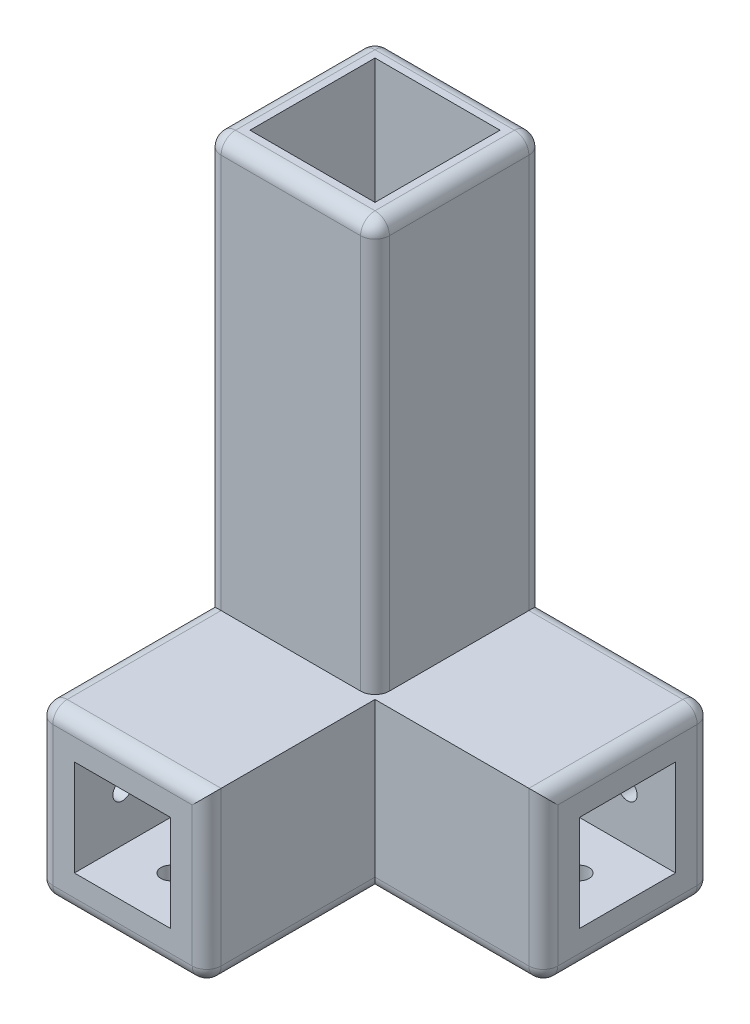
ISO-10303-21;
HEADER;
FILE_DESCRIPTION(('STEP AP214'),'2;1');
FILE_NAME('part.step','',(''),(''),'','','');
FILE_SCHEMA(('AUTOMOTIVE_DESIGN { 1 0 10303 214 1 1 1 1 }'));
ENDSEC;
DATA;
#1=APPLICATION_CONTEXT('core data for automotive mechanical design processes');
#2=APPLICATION_PROTOCOL_DEFINITION('international standard','automotive_design',2000,#1);
#3=PRODUCT_CONTEXT('',#1,'mechanical');
#4=PRODUCT('Part','Part','',(#3));
#5=PRODUCT_RELATED_PRODUCT_CATEGORY('part','',(#4));
#6=PRODUCT_DEFINITION_FORMATION('','',#4);
#7=PRODUCT_DEFINITION_CONTEXT('part definition',#1,'design');
#8=PRODUCT_DEFINITION('design','',#6,#7);
#9=PRODUCT_DEFINITION_SHAPE('','',#8);
#10=(LENGTH_UNIT() NAMED_UNIT(*) SI_UNIT(.MILLI.,.METRE.));
#11=(NAMED_UNIT(*) PLANE_ANGLE_UNIT() SI_UNIT($,.RADIAN.));
#12=(NAMED_UNIT(*) SI_UNIT($,.STERADIAN.) SOLID_ANGLE_UNIT());
#13=UNCERTAINTY_MEASURE_WITH_UNIT(LENGTH_MEASURE(1.E-05),#10,'distance_accuracy_value','');
#14=(GEOMETRIC_REPRESENTATION_CONTEXT(3) GLOBAL_UNCERTAINTY_ASSIGNED_CONTEXT((#13)) GLOBAL_UNIT_ASSIGNED_CONTEXT((#10,
#11,#12)) REPRESENTATION_CONTEXT('',''));
#15=CARTESIAN_POINT('',(0.,0.,0.));
#16=DIRECTION('',(0.,0.,1.));
#17=DIRECTION('',(1.,0.,0.));
#18=AXIS2_PLACEMENT_3D('',#15,#16,#17);
#19=CARTESIAN_POINT('',(0.,0.,35.));
#20=DIRECTION('',(0.,0.,1.));
#21=DIRECTION('',(1.,0.,0.));
#22=AXIS2_PLACEMENT_3D('',#19,#20,#21);
#23=PLANE('',#22);
#24=DIRECTION('',(0.,1.,0.));
#25=VECTOR('',#24,1.);
#26=CARTESIAN_POINT('',(35.,0.,35.));
#27=LINE('',#26,#25);
#28=CARTESIAN_POINT('',(35.,3.,35.));
#29=VERTEX_POINT('',#28);
#30=CARTESIAN_POINT('',(35.,35.,35.));
#31=VERTEX_POINT('',#30);
#32=EDGE_CURVE('E419',#29,#31,#27,.T.);
#33=ORIENTED_EDGE('',*,*,#32,.F.);
#34=DIRECTION('',(1.,0.,0.));
#35=VECTOR('',#34,1.);
#36=CARTESIAN_POINT('',(70.,3.,35.));
#37=LINE('',#36,#35);
#38=CARTESIAN_POINT('',(67.,3.,35.));
#39=VERTEX_POINT('',#38);
#40=EDGE_CURVE('E481',#29,#39,#37,.T.);
#41=ORIENTED_EDGE('',*,*,#40,.T.);
#42=DIRECTION('',(0.,1.,0.));
#43=VECTOR('',#42,1.);
#44=CARTESIAN_POINT('',(67.,35.,35.));
#45=LINE('',#44,#43);
#46=CARTESIAN_POINT('',(67.,35.,35.));
#47=VERTEX_POINT('',#46);
#48=EDGE_CURVE('E478',#39,#47,#45,.T.);
#49=ORIENTED_EDGE('',*,*,#48,.T.);
#50=DIRECTION('',(-1.,0.,0.));
#51=VECTOR('',#50,1.);
#52=CARTESIAN_POINT('',(70.,35.,35.));
#53=LINE('',#52,#51);
#54=EDGE_CURVE('E437',#47,#31,#53,.T.);
#55=ORIENTED_EDGE('',*,*,#54,.T.);
#56=EDGE_LOOP('',(#33,#41,#49,#55));
#57=FACE_BOUND('',#56,.T.);
#58=ADVANCED_FACE('F45',(#57),#23,.T.);
#59=CARTESIAN_POINT('',(0.,70.,35.));
#60=DIRECTION('',(1.,0.,0.));
#61=DIRECTION('',(0.,1.,0.));
#62=AXIS2_PLACEMENT_3D('',#59,#60,#61);
#63=PLANE('',#62);
#64=CARTESIAN_POINT('',(0.,100.,17.5));
#65=DIRECTION('',(-1.,0.,0.));
#66=DIRECTION('',(0.,-1.,0.));
#67=AXIS2_PLACEMENT_3D('',#64,#65,#66);
#68=CIRCLE('',#67,2.);
#69=CARTESIAN_POINT('',(0.,98.,17.5));
#70=VERTEX_POINT('',#69);
#71=EDGE_CURVE('E309',#70,#70,#68,.T.);
#72=ORIENTED_EDGE('',*,*,#71,.F.);
#73=EDGE_LOOP('',(#72));
#74=FACE_BOUND('',#73,.T.);
#75=CARTESIAN_POINT('',(0.,17.5,60.));
#76=DIRECTION('',(-1.,0.,0.));
#77=DIRECTION('',(0.,-1.,0.));
#78=AXIS2_PLACEMENT_3D('',#75,#76,#77);
#79=CIRCLE('',#78,2.);
#80=CARTESIAN_POINT('',(0.,15.5,60.));
#81=VERTEX_POINT('',#80);
#82=EDGE_CURVE('E338',#81,#81,#79,.T.);
#83=ORIENTED_EDGE('',*,*,#82,.F.);
#84=EDGE_LOOP('',(#83));
#85=FACE_BOUND('',#84,.T.);
#86=DIRECTION('',(0.,0.,1.));
#87=VECTOR('',#86,1.);
#88=CARTESIAN_POINT('',(0.,117.,0.));
#89=LINE('',#88,#87);
#90=CARTESIAN_POINT('',(0.,117.,32.));
#91=VERTEX_POINT('',#90);
#92=CARTESIAN_POINT('',(0.,117.,3.));
#93=VERTEX_POINT('',#92);
#94=EDGE_CURVE('E71',#91,#93,#89,.F.);
#95=ORIENTED_EDGE('',*,*,#94,.T.);
#96=DIRECTION('',(0.,-1.,0.));
#97=VECTOR('',#96,1.);
#98=CARTESIAN_POINT('',(0.,70.,3.));
#99=LINE('',#98,#97);
#100=CARTESIAN_POINT('',(0.,3.,3.));
#101=VERTEX_POINT('',#100);
#102=EDGE_CURVE('E674',#93,#101,#99,.T.);
#103=ORIENTED_EDGE('',*,*,#102,.T.);
#104=DIRECTION('',(0.,0.,-1.));
#105=VECTOR('',#104,1.);
#106=CARTESIAN_POINT('',(0.,3.,35.));
#107=LINE('',#106,#105);
#108=CARTESIAN_POINT('',(0.,3.,67.));
#109=VERTEX_POINT('',#108);
#110=EDGE_CURVE('E533',#101,#109,#107,.F.);
#111=ORIENTED_EDGE('',*,*,#110,.T.);
#112=DIRECTION('',(0.,-1.,0.));
#113=VECTOR('',#112,1.);
#114=CARTESIAN_POINT('',(0.,35.,67.));
#115=LINE('',#114,#113);
#116=CARTESIAN_POINT('',(0.,32.,67.));
#117=VERTEX_POINT('',#116);
#118=EDGE_CURVE('E530',#109,#117,#115,.F.);
#119=ORIENTED_EDGE('',*,*,#118,.T.);
#120=DIRECTION('',(0.,0.,-1.));
#121=VECTOR('',#120,1.);
#122=CARTESIAN_POINT('',(0.,32.,35.));
#123=LINE('',#122,#121);
#124=CARTESIAN_POINT('',(0.,32.,32.));
#125=VERTEX_POINT('',#124);
#126=EDGE_CURVE('E527',#117,#125,#123,.T.);
#127=ORIENTED_EDGE('',*,*,#126,.T.);
#128=DIRECTION('',(0.,-1.,0.));
#129=VECTOR('',#128,1.);
#130=CARTESIAN_POINT('',(0.,120.,32.));
#131=LINE('',#130,#129);
#132=EDGE_CURVE('E669',#125,#91,#131,.F.);
#133=ORIENTED_EDGE('',*,*,#132,.T.);
#134=EDGE_LOOP('',(#95,#103,#111,#119,#127,#133));
#135=FACE_BOUND('',#134,.T.);
#136=ADVANCED_FACE('F909',(#74,#85,#135),#63,.F.);
#137=CARTESIAN_POINT('',(0.,0.,35.));
#138=DIRECTION('',(0.,1.,0.));
#139=DIRECTION('',(0.,0.,1.));
#140=AXIS2_PLACEMENT_3D('',#137,#138,#139);
#141=PLANE('',#140);
#142=CARTESIAN_POINT('',(17.5,0.,60.));
#143=DIRECTION('',(0.,-1.,0.));
#144=DIRECTION('',(0.,0.,-1.));
#145=AXIS2_PLACEMENT_3D('',#142,#143,#144);
#146=CIRCLE('',#145,2.);
#147=CARTESIAN_POINT('',(17.5,0.,58.));
#148=VERTEX_POINT('',#147);
#149=EDGE_CURVE('E743',#148,#148,#146,.T.);
#150=ORIENTED_EDGE('',*,*,#149,.F.);
#151=EDGE_LOOP('',(#150));
#152=FACE_BOUND('',#151,.T.);
#153=CARTESIAN_POINT('',(60.,0.,17.5));
#154=DIRECTION('',(0.,-1.,0.));
#155=DIRECTION('',(0.,0.,-1.));
#156=AXIS2_PLACEMENT_3D('',#153,#154,#155);
#157=CIRCLE('',#156,2.);
#158=CARTESIAN_POINT('',(60.,0.,15.5));
#159=VERTEX_POINT('',#158);
#160=EDGE_CURVE('E750',#159,#159,#157,.T.);
#161=ORIENTED_EDGE('',*,*,#160,.F.);
#162=EDGE_LOOP('',(#161));
#163=FACE_BOUND('',#162,.T.);
#164=DIRECTION('',(1.,0.,0.));
#165=VECTOR('',#164,1.);
#166=CARTESIAN_POINT('',(0.,0.,3.));
#167=LINE('',#166,#165);
#168=CARTESIAN_POINT('',(3.,0.,3.));
#169=VERTEX_POINT('',#168);
#170=CARTESIAN_POINT('',(67.,0.,3.));
#171=VERTEX_POINT('',#170);
#172=EDGE_CURVE('E462',#169,#171,#167,.T.);
#173=ORIENTED_EDGE('',*,*,#172,.T.);
#174=DIRECTION('',(0.,0.,-1.));
#175=VECTOR('',#174,1.);
#176=CARTESIAN_POINT('',(67.,0.,35.));
#177=LINE('',#176,#175);
#178=CARTESIAN_POINT('',(67.,0.,32.));
#179=VERTEX_POINT('',#178);
#180=EDGE_CURVE('E474',#171,#179,#177,.F.);
#181=ORIENTED_EDGE('',*,*,#180,.T.);
#182=DIRECTION('',(1.,0.,0.));
#183=VECTOR('',#182,1.);
#184=CARTESIAN_POINT('',(35.,0.,32.));
#185=LINE('',#184,#183);
#186=CARTESIAN_POINT('',(32.,0.,32.));
#187=VERTEX_POINT('',#186);
#188=EDGE_CURVE('E471',#179,#187,#185,.F.);
#189=ORIENTED_EDGE('',*,*,#188,.T.);
#190=DIRECTION('',(0.,0.,-1.));
#191=VECTOR('',#190,1.);
#192=CARTESIAN_POINT('',(32.,0.,35.));
#193=LINE('',#192,#191);
#194=CARTESIAN_POINT('',(32.,0.,67.));
#195=VERTEX_POINT('',#194);
#196=EDGE_CURVE('E468',#187,#195,#193,.F.);
#197=ORIENTED_EDGE('',*,*,#196,.T.);
#198=DIRECTION('',(1.,0.,0.));
#199=VECTOR('',#198,1.);
#200=CARTESIAN_POINT('',(0.,0.,67.));
#201=LINE('',#200,#199);
#202=CARTESIAN_POINT('',(3.,0.,67.));
#203=VERTEX_POINT('',#202);
#204=EDGE_CURVE('E465',#195,#203,#201,.F.);
#205=ORIENTED_EDGE('',*,*,#204,.T.);
#206=DIRECTION('',(0.,0.,-1.));
#207=VECTOR('',#206,1.);
#208=CARTESIAN_POINT('',(3.,0.,35.));
#209=LINE('',#208,#207);
#210=EDGE_CURVE('E458',#203,#169,#209,.T.);
#211=ORIENTED_EDGE('',*,*,#210,.T.);
#212=EDGE_LOOP('',(#173,#181,#189,#197,#205,#211));
#213=FACE_BOUND('',#212,.T.);
#214=ADVANCED_FACE('F914',(#152,#163,#213),#141,.F.);
#215=CARTESIAN_POINT('',(70.,0.,35.));
#216=DIRECTION('',(-1.,0.,0.));
#217=DIRECTION('',(0.,0.,1.));
#218=AXIS2_PLACEMENT_3D('',#215,#216,#217);
#219=PLANE('',#218);
#220=DIRECTION('',(0.,1.,0.));
#221=VECTOR('',#220,1.);
#222=CARTESIAN_POINT('',(70.,0.,32.));
#223=LINE('',#222,#221);
#224=CARTESIAN_POINT('',(70.,32.,32.));
#225=VERTEX_POINT('',#224);
#226=CARTESIAN_POINT('',(70.,3.,32.));
#227=VERTEX_POINT('',#226);
#228=EDGE_CURVE('E451',#225,#227,#223,.F.);
#229=ORIENTED_EDGE('',*,*,#228,.T.);
#230=DIRECTION('',(0.,0.,-1.));
#231=VECTOR('',#230,1.);
#232=CARTESIAN_POINT('',(70.,3.,35.));
#233=LINE('',#232,#231);
#234=CARTESIAN_POINT('',(70.,3.,3.));
#235=VERTEX_POINT('',#234);
#236=EDGE_CURVE('E454',#227,#235,#233,.T.);
#237=ORIENTED_EDGE('',*,*,#236,.T.);
#238=DIRECTION('',(0.,1.,0.));
#239=VECTOR('',#238,1.);
#240=CARTESIAN_POINT('',(70.,0.,3.));
#241=LINE('',#240,#239);
#242=CARTESIAN_POINT('',(70.,32.,3.));
#243=VERTEX_POINT('',#242);
#244=EDGE_CURVE('E445',#235,#243,#241,.T.);
#245=ORIENTED_EDGE('',*,*,#244,.T.);
#246=DIRECTION('',(0.,0.,-1.));
#247=VECTOR('',#246,1.);
#248=CARTESIAN_POINT('',(70.,32.,35.));
#249=LINE('',#248,#247);
#250=EDGE_CURVE('E448',#243,#225,#249,.F.);
#251=ORIENTED_EDGE('',*,*,#250,.T.);
#252=EDGE_LOOP('',(#229,#237,#245,#251));
#253=FACE_BOUND('',#252,.T.);
#254=DIRECTION('',(0.,0.,-1.));
#255=VECTOR('',#254,1.);
#256=CARTESIAN_POINT('',(70.,7.5,27.5));
#257=LINE('',#256,#255);
#258=CARTESIAN_POINT('',(70.,7.5,27.5));
#259=VERTEX_POINT('',#258);
#260=CARTESIAN_POINT('',(70.,7.5,7.5));
#261=VERTEX_POINT('',#260);
#262=EDGE_CURVE('E362',#259,#261,#257,.T.);
#263=ORIENTED_EDGE('',*,*,#262,.F.);
#264=DIRECTION('',(0.,-1.,0.));
#265=VECTOR('',#264,1.);
#266=CARTESIAN_POINT('',(70.,27.5,27.5));
#267=LINE('',#266,#265);
#268=CARTESIAN_POINT('',(70.,27.5,27.5));
#269=VERTEX_POINT('',#268);
#270=EDGE_CURVE('E359',#269,#259,#267,.T.);
#271=ORIENTED_EDGE('',*,*,#270,.F.);
#272=DIRECTION('',(0.,0.,-1.));
#273=VECTOR('',#272,1.);
#274=CARTESIAN_POINT('',(70.,27.5,27.5));
#275=LINE('',#274,#273);
#276=CARTESIAN_POINT('',(70.,27.5,7.50000000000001));
#277=VERTEX_POINT('',#276);
#278=EDGE_CURVE('E348',#269,#277,#275,.T.);
#279=ORIENTED_EDGE('',*,*,#278,.T.);
#280=DIRECTION('',(0.,-1.,0.));
#281=VECTOR('',#280,1.);
#282=CARTESIAN_POINT('',(70.,27.5,7.50000000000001));
#283=LINE('',#282,#281);
#284=EDGE_CURVE('E367',#277,#261,#283,.T.);
#285=ORIENTED_EDGE('',*,*,#284,.T.);
#286=EDGE_LOOP('',(#263,#271,#279,#285));
#287=FACE_BOUND('',#286,.T.);
#288=ADVANCED_FACE('F805',(#253,#287),#219,.F.);
#289=CARTESIAN_POINT('',(70.,35.,35.));
#290=DIRECTION('',(0.,-1.,0.));
#291=DIRECTION('',(0.,0.,-1.));
#292=AXIS2_PLACEMENT_3D('',#289,#290,#291);
#293=PLANE('',#292);
#294=ORIENTED_EDGE('',*,*,#54,.F.);
#295=DIRECTION('',(0.,0.,-1.));
#296=VECTOR('',#295,1.);
#297=CARTESIAN_POINT('',(67.,35.,35.));
#298=LINE('',#297,#296);
#299=CARTESIAN_POINT('',(67.,35.,3.));
#300=VERTEX_POINT('',#299);
#301=EDGE_CURVE('E508',#47,#300,#298,.T.);
#302=ORIENTED_EDGE('',*,*,#301,.T.);
#303=DIRECTION('',(-1.,0.,0.));
#304=VECTOR('',#303,1.);
#305=CARTESIAN_POINT('',(70.,35.,3.));
#306=LINE('',#305,#304);
#307=CARTESIAN_POINT('',(35.,35.,3.));
#308=VERTEX_POINT('',#307);
#309=EDGE_CURVE('E504',#300,#308,#306,.T.);
#310=ORIENTED_EDGE('',*,*,#309,.T.);
#311=DIRECTION('',(0.,0.,-1.));
#312=VECTOR('',#311,1.);
#313=CARTESIAN_POINT('',(35.,35.,35.));
#314=LINE('',#313,#312);
#315=CARTESIAN_POINT('',(35.,35.,32.));
#316=VERTEX_POINT('',#315);
#317=EDGE_CURVE('E441',#316,#308,#314,.T.);
#318=ORIENTED_EDGE('',*,*,#317,.F.);
#319=CARTESIAN_POINT('',(32.,35.,32.));
#320=DIRECTION('',(0.,-1.,0.));
#321=DIRECTION('',(0.,0.,-1.));
#322=AXIS2_PLACEMENT_3D('',#319,#320,#321);
#323=CIRCLE('',#322,3.);
#324=CARTESIAN_POINT('',(32.,35.,35.));
#325=VERTEX_POINT('',#324);
#326=EDGE_CURVE('E677',#316,#325,#323,.T.);
#327=ORIENTED_EDGE('',*,*,#326,.T.);
#328=DIRECTION('',(-1.,0.,0.));
#329=VECTOR('',#328,1.);
#330=CARTESIAN_POINT('',(35.,35.,35.));
#331=LINE('',#330,#329);
#332=CARTESIAN_POINT('',(3.,35.,35.));
#333=VERTEX_POINT('',#332);
#334=EDGE_CURVE('E63',#325,#333,#331,.T.);
#335=ORIENTED_EDGE('',*,*,#334,.T.);
#336=DIRECTION('',(0.,0.,-1.));
#337=VECTOR('',#336,1.);
#338=CARTESIAN_POINT('',(3.,35.,70.));
#339=LINE('',#338,#337);
#340=CARTESIAN_POINT('',(3.,35.,67.));
#341=VERTEX_POINT('',#340);
#342=EDGE_CURVE('E521',#333,#341,#339,.F.);
#343=ORIENTED_EDGE('',*,*,#342,.T.);
#344=DIRECTION('',(-1.,0.,0.));
#345=VECTOR('',#344,1.);
#346=CARTESIAN_POINT('',(35.,35.,67.));
#347=LINE('',#346,#345);
#348=CARTESIAN_POINT('',(35.,35.,67.));
#349=VERTEX_POINT('',#348);
#350=EDGE_CURVE('E524',#341,#349,#347,.F.);
#351=ORIENTED_EDGE('',*,*,#350,.T.);
#352=DIRECTION('',(0.,0.,-1.));
#353=VECTOR('',#352,1.);
#354=CARTESIAN_POINT('',(35.,35.,70.));
#355=LINE('',#354,#353);
#356=EDGE_CURVE('E434',#349,#31,#355,.T.);
#357=ORIENTED_EDGE('',*,*,#356,.T.);
#358=EDGE_LOOP('',(#294,#302,#310,#318,#327,#335,#343,#351,#357));
#359=FACE_BOUND('',#358,.T.);
#360=ADVANCED_FACE('F792',(#359),#293,.F.);
#361=CARTESIAN_POINT('',(35.,35.,35.));
#362=DIRECTION('',(-1.,0.,0.));
#363=DIRECTION('',(0.,0.,1.));
#364=AXIS2_PLACEMENT_3D('',#361,#362,#363);
#365=PLANE('',#364);
#366=DIRECTION('',(0.,0.,-1.));
#367=VECTOR('',#366,1.);
#368=CARTESIAN_POINT('',(35.,117.,35.));
#369=LINE('',#368,#367);
#370=CARTESIAN_POINT('',(35.,117.,3.));
#371=VERTEX_POINT('',#370);
#372=CARTESIAN_POINT('',(35.,117.,32.));
#373=VERTEX_POINT('',#372);
#374=EDGE_CURVE('E644',#371,#373,#369,.F.);
#375=ORIENTED_EDGE('',*,*,#374,.T.);
#376=DIRECTION('',(0.,1.,0.));
#377=VECTOR('',#376,1.);
#378=CARTESIAN_POINT('',(35.,35.,32.));
#379=LINE('',#378,#377);
#380=EDGE_CURVE('E647',#373,#316,#379,.F.);
#381=ORIENTED_EDGE('',*,*,#380,.T.);
#382=ORIENTED_EDGE('',*,*,#317,.T.);
#383=DIRECTION('',(0.,1.,0.));
#384=VECTOR('',#383,1.);
#385=CARTESIAN_POINT('',(35.,35.,3.));
#386=LINE('',#385,#384);
#387=EDGE_CURVE('E641',#308,#371,#386,.T.);
#388=ORIENTED_EDGE('',*,*,#387,.T.);
#389=EDGE_LOOP('',(#375,#381,#382,#388));
#390=FACE_BOUND('',#389,.T.);
#391=ADVANCED_FACE('F786',(#390),#365,.F.);
#392=ORIENTED_EDGE('',*,*,#334,.F.);
#393=DIRECTION('',(0.,1.,0.));
#394=VECTOR('',#393,1.);
#395=CARTESIAN_POINT('',(32.,120.,35.));
#396=LINE('',#395,#394);
#397=CARTESIAN_POINT('',(32.,117.,35.));
#398=VERTEX_POINT('',#397);
#399=EDGE_CURVE('E656',#325,#398,#396,.T.);
#400=ORIENTED_EDGE('',*,*,#399,.T.);
#401=DIRECTION('',(1.,0.,0.));
#402=VECTOR('',#401,1.);
#403=CARTESIAN_POINT('',(0.,117.,35.));
#404=LINE('',#403,#402);
#405=CARTESIAN_POINT('',(3.,117.,35.));
#406=VERTEX_POINT('',#405);
#407=EDGE_CURVE('E653',#398,#406,#404,.F.);
#408=ORIENTED_EDGE('',*,*,#407,.T.);
#409=DIRECTION('',(0.,-1.,0.));
#410=VECTOR('',#409,1.);
#411=CARTESIAN_POINT('',(3.,32.,35.));
#412=LINE('',#411,#410);
#413=EDGE_CURVE('E650',#406,#333,#412,.T.);
#414=ORIENTED_EDGE('',*,*,#413,.T.);
#415=EDGE_LOOP('',(#392,#400,#408,#414));
#416=FACE_BOUND('',#415,.T.);
#417=ADVANCED_FACE('F768',(#416),#23,.T.);
#418=CARTESIAN_POINT('',(0.,0.,0.));
#419=DIRECTION('',(0.,0.,1.));
#420=DIRECTION('',(1.,0.,0.));
#421=AXIS2_PLACEMENT_3D('',#418,#419,#420);
#422=PLANE('',#421);
#423=CARTESIAN_POINT('',(17.5,100.,0.));
#424=DIRECTION('',(0.,0.,-1.));
#425=DIRECTION('',(-1.,0.,0.));
#426=AXIS2_PLACEMENT_3D('',#423,#424,#425);
#427=CIRCLE('',#426,2.);
#428=CARTESIAN_POINT('',(15.5,100.,0.));
#429=VERTEX_POINT('',#428);
#430=EDGE_CURVE('E739',#429,#429,#427,.T.);
#431=ORIENTED_EDGE('',*,*,#430,.F.);
#432=EDGE_LOOP('',(#431));
#433=FACE_BOUND('',#432,.T.);
#434=CARTESIAN_POINT('',(60.,17.5,0.));
#435=DIRECTION('',(0.,0.,-1.));
#436=DIRECTION('',(-1.,0.,0.));
#437=AXIS2_PLACEMENT_3D('',#434,#435,#436);
#438=CIRCLE('',#437,2.);
#439=CARTESIAN_POINT('',(58.,17.5,0.));
#440=VERTEX_POINT('',#439);
#441=EDGE_CURVE('E328',#440,#440,#438,.T.);
#442=ORIENTED_EDGE('',*,*,#441,.F.);
#443=EDGE_LOOP('',(#442));
#444=FACE_BOUND('',#443,.T.);
#445=DIRECTION('',(0.,1.,0.));
#446=VECTOR('',#445,1.);
#447=CARTESIAN_POINT('',(32.,0.,0.));
#448=LINE('',#447,#446);
#449=CARTESIAN_POINT('',(32.,117.,0.));
#450=VERTEX_POINT('',#449);
#451=CARTESIAN_POINT('',(32.,32.,0.));
#452=VERTEX_POINT('',#451);
#453=EDGE_CURVE('E665',#450,#452,#448,.F.);
#454=ORIENTED_EDGE('',*,*,#453,.T.);
#455=DIRECTION('',(-1.,0.,0.));
#456=VECTOR('',#455,1.);
#457=CARTESIAN_POINT('',(0.,32.,0.));
#458=LINE('',#457,#456);
#459=CARTESIAN_POINT('',(67.,32.,0.));
#460=VERTEX_POINT('',#459);
#461=EDGE_CURVE('E511',#452,#460,#458,.F.);
#462=ORIENTED_EDGE('',*,*,#461,.T.);
#463=DIRECTION('',(0.,1.,0.));
#464=VECTOR('',#463,1.);
#465=CARTESIAN_POINT('',(67.,0.,0.));
#466=LINE('',#465,#464);
#467=CARTESIAN_POINT('',(67.,3.,0.));
#468=VERTEX_POINT('',#467);
#469=EDGE_CURVE('E514',#460,#468,#466,.F.);
#470=ORIENTED_EDGE('',*,*,#469,.T.);
#471=DIRECTION('',(1.,0.,0.));
#472=VECTOR('',#471,1.);
#473=CARTESIAN_POINT('',(0.,3.,0.));
#474=LINE('',#473,#472);
#475=CARTESIAN_POINT('',(3.,3.,0.));
#476=VERTEX_POINT('',#475);
#477=EDGE_CURVE('E517',#468,#476,#474,.F.);
#478=ORIENTED_EDGE('',*,*,#477,.T.);
#479=DIRECTION('',(0.,-1.,0.));
#480=VECTOR('',#479,1.);
#481=CARTESIAN_POINT('',(3.,0.,0.));
#482=LINE('',#481,#480);
#483=CARTESIAN_POINT('',(3.,117.,0.));
#484=VERTEX_POINT('',#483);
#485=EDGE_CURVE('E659',#476,#484,#482,.F.);
#486=ORIENTED_EDGE('',*,*,#485,.T.);
#487=DIRECTION('',(-1.,0.,0.));
#488=VECTOR('',#487,1.);
#489=CARTESIAN_POINT('',(35.,117.,0.));
#490=LINE('',#489,#488);
#491=EDGE_CURVE('E662',#484,#450,#490,.F.);
#492=ORIENTED_EDGE('',*,*,#491,.T.);
#493=EDGE_LOOP('',(#454,#462,#470,#478,#486,#492));
#494=FACE_BOUND('',#493,.T.);
#495=ADVANCED_FACE('F764',(#433,#444,#494),#422,.F.);
#496=CARTESIAN_POINT('',(35.,0.,70.));
#497=DIRECTION('',(-1.,0.,0.));
#498=DIRECTION('',(0.,0.,1.));
#499=AXIS2_PLACEMENT_3D('',#496,#497,#498);
#500=PLANE('',#499);
#501=DIRECTION('',(0.,1.,0.));
#502=VECTOR('',#501,1.);
#503=CARTESIAN_POINT('',(35.,0.,67.));
#504=LINE('',#503,#502);
#505=CARTESIAN_POINT('',(35.,3.,67.));
#506=VERTEX_POINT('',#505);
#507=EDGE_CURVE('E485',#349,#506,#504,.F.);
#508=ORIENTED_EDGE('',*,*,#507,.T.);
#509=DIRECTION('',(0.,0.,-1.));
#510=VECTOR('',#509,1.);
#511=CARTESIAN_POINT('',(35.,3.,70.));
#512=LINE('',#511,#510);
#513=EDGE_CURVE('E488',#506,#29,#512,.T.);
#514=ORIENTED_EDGE('',*,*,#513,.T.);
#515=ORIENTED_EDGE('',*,*,#32,.T.);
#516=ORIENTED_EDGE('',*,*,#356,.F.);
#517=EDGE_LOOP('',(#508,#514,#515,#516));
#518=FACE_BOUND('',#517,.T.);
#519=ADVANCED_FACE('F767',(#518),#500,.F.);
#520=CARTESIAN_POINT('',(0.,0.,70.));
#521=DIRECTION('',(0.,0.,1.));
#522=DIRECTION('',(1.,0.,0.));
#523=AXIS2_PLACEMENT_3D('',#520,#521,#522);
#524=PLANE('',#523);
#525=DIRECTION('',(0.,-1.,0.));
#526=VECTOR('',#525,1.);
#527=CARTESIAN_POINT('',(3.,0.,70.));
#528=LINE('',#527,#526);
#529=CARTESIAN_POINT('',(3.,32.,70.));
#530=VERTEX_POINT('',#529);
#531=CARTESIAN_POINT('',(3.,3.,70.));
#532=VERTEX_POINT('',#531);
#533=EDGE_CURVE('E491',#530,#532,#528,.T.);
#534=ORIENTED_EDGE('',*,*,#533,.T.);
#535=DIRECTION('',(1.,0.,0.));
#536=VECTOR('',#535,1.);
#537=CARTESIAN_POINT('',(35.,3.,70.));
#538=LINE('',#537,#536);
#539=CARTESIAN_POINT('',(32.,3.,70.));
#540=VERTEX_POINT('',#539);
#541=EDGE_CURVE('E500',#532,#540,#538,.T.);
#542=ORIENTED_EDGE('',*,*,#541,.T.);
#543=DIRECTION('',(0.,1.,0.));
#544=VECTOR('',#543,1.);
#545=CARTESIAN_POINT('',(32.,35.,70.));
#546=LINE('',#545,#544);
#547=CARTESIAN_POINT('',(32.,32.,70.));
#548=VERTEX_POINT('',#547);
#549=EDGE_CURVE('E497',#540,#548,#546,.T.);
#550=ORIENTED_EDGE('',*,*,#549,.T.);
#551=DIRECTION('',(-1.,0.,0.));
#552=VECTOR('',#551,1.);
#553=CARTESIAN_POINT('',(0.,32.,70.));
#554=LINE('',#553,#552);
#555=EDGE_CURVE('E494',#548,#530,#554,.T.);
#556=ORIENTED_EDGE('',*,*,#555,.T.);
#557=EDGE_LOOP('',(#534,#542,#550,#556));
#558=FACE_BOUND('',#557,.T.);
#559=DIRECTION('',(0.,-1.,0.));
#560=VECTOR('',#559,1.);
#561=CARTESIAN_POINT('',(7.5,27.5,70.));
#562=LINE('',#561,#560);
#563=CARTESIAN_POINT('',(7.5,27.5,70.));
#564=VERTEX_POINT('',#563);
#565=CARTESIAN_POINT('',(7.5,7.5,70.));
#566=VERTEX_POINT('',#565);
#567=EDGE_CURVE('E377',#564,#566,#562,.T.);
#568=ORIENTED_EDGE('',*,*,#567,.F.);
#569=DIRECTION('',(1.,0.,0.));
#570=VECTOR('',#569,1.);
#571=CARTESIAN_POINT('',(7.5,27.5,70.));
#572=LINE('',#571,#570);
#573=CARTESIAN_POINT('',(27.5,27.5,70.));
#574=VERTEX_POINT('',#573);
#575=EDGE_CURVE('E392',#564,#574,#572,.T.);
#576=ORIENTED_EDGE('',*,*,#575,.T.);
#577=DIRECTION('',(0.,-1.,0.));
#578=VECTOR('',#577,1.);
#579=CARTESIAN_POINT('',(27.5,27.5,70.));
#580=LINE('',#579,#578);
#581=CARTESIAN_POINT('',(27.5,7.5,70.));
#582=VERTEX_POINT('',#581);
#583=EDGE_CURVE('E409',#574,#582,#580,.T.);
#584=ORIENTED_EDGE('',*,*,#583,.T.);
#585=DIRECTION('',(1.,0.,0.));
#586=VECTOR('',#585,1.);
#587=CARTESIAN_POINT('',(7.5,7.5,70.));
#588=LINE('',#587,#586);
#589=EDGE_CURVE('E405',#566,#582,#588,.T.);
#590=ORIENTED_EDGE('',*,*,#589,.F.);
#591=EDGE_LOOP('',(#568,#576,#584,#590));
#592=FACE_BOUND('',#591,.T.);
#593=ADVANCED_FACE('F956',(#558,#592),#524,.T.);
#594=CARTESIAN_POINT('',(7.5,27.5,50.));
#595=DIRECTION('',(-1.,0.,0.));
#596=DIRECTION('',(0.,-1.,0.));
#597=AXIS2_PLACEMENT_3D('',#594,#595,#596);
#598=PLANE('',#597);
#599=CARTESIAN_POINT('',(7.5,17.5,60.));
#600=DIRECTION('',(-1.,0.,0.));
#601=DIRECTION('',(0.,-1.,0.));
#602=AXIS2_PLACEMENT_3D('',#599,#600,#601);
#603=CIRCLE('',#602,2.);
#604=CARTESIAN_POINT('',(7.5,15.5,60.));
#605=VERTEX_POINT('',#604);
#606=EDGE_CURVE('E342',#605,#605,#603,.T.);
#607=ORIENTED_EDGE('',*,*,#606,.T.);
#608=EDGE_LOOP('',(#607));
#609=FACE_BOUND('',#608,.T.);
#610=ORIENTED_EDGE('',*,*,#567,.T.);
#611=DIRECTION('',(0.,0.,1.));
#612=VECTOR('',#611,1.);
#613=CARTESIAN_POINT('',(7.5,7.5,50.));
#614=LINE('',#613,#612);
#615=CARTESIAN_POINT('',(7.5,7.5,50.));
#616=VERTEX_POINT('',#615);
#617=EDGE_CURVE('E402',#616,#566,#614,.T.);
#618=ORIENTED_EDGE('',*,*,#617,.F.);
#619=DIRECTION('',(0.,-1.,0.));
#620=VECTOR('',#619,1.);
#621=CARTESIAN_POINT('',(7.5,27.5,50.));
#622=LINE('',#621,#620);
#623=CARTESIAN_POINT('',(7.5,27.5,50.));
#624=VERTEX_POINT('',#623);
#625=EDGE_CURVE('E387',#624,#616,#622,.T.);
#626=ORIENTED_EDGE('',*,*,#625,.F.);
#627=DIRECTION('',(0.,0.,1.));
#628=VECTOR('',#627,1.);
#629=CARTESIAN_POINT('',(7.5,27.5,50.));
#630=LINE('',#629,#628);
#631=EDGE_CURVE('E416',#624,#564,#630,.T.);
#632=ORIENTED_EDGE('',*,*,#631,.T.);
#633=EDGE_LOOP('',(#610,#618,#626,#632));
#634=FACE_BOUND('',#633,.T.);
#635=ADVANCED_FACE('F1078',(#609,#634),#598,.F.);
#636=CARTESIAN_POINT('',(7.5,27.5,50.));
#637=DIRECTION('',(0.,-1.,0.));
#638=DIRECTION('',(0.,0.,-1.));
#639=AXIS2_PLACEMENT_3D('',#636,#637,#638);
#640=PLANE('',#639);
#641=ORIENTED_EDGE('',*,*,#575,.F.);
#642=ORIENTED_EDGE('',*,*,#631,.F.);
#643=DIRECTION('',(1.,0.,0.));
#644=VECTOR('',#643,1.);
#645=CARTESIAN_POINT('',(7.5,27.5,50.));
#646=LINE('',#645,#644);
#647=CARTESIAN_POINT('',(27.5,27.5,50.));
#648=VERTEX_POINT('',#647);
#649=EDGE_CURVE('E399',#624,#648,#646,.T.);
#650=ORIENTED_EDGE('',*,*,#649,.T.);
#651=DIRECTION('',(0.,0.,1.));
#652=VECTOR('',#651,1.);
#653=CARTESIAN_POINT('',(27.5,27.5,50.));
#654=LINE('',#653,#652);
#655=EDGE_CURVE('E420',#648,#574,#654,.T.);
#656=ORIENTED_EDGE('',*,*,#655,.T.);
#657=EDGE_LOOP('',(#641,#642,#650,#656));
#658=FACE_BOUND('',#657,.T.);
#659=ADVANCED_FACE('F1074',(#658),#640,.T.);
#660=CARTESIAN_POINT('',(27.5,27.5,50.));
#661=DIRECTION('',(-1.,0.,0.));
#662=DIRECTION('',(0.,-1.,0.));
#663=AXIS2_PLACEMENT_3D('',#660,#661,#662);
#664=PLANE('',#663);
#665=ORIENTED_EDGE('',*,*,#583,.F.);
#666=ORIENTED_EDGE('',*,*,#655,.F.);
#667=DIRECTION('',(0.,-1.,0.));
#668=VECTOR('',#667,1.);
#669=CARTESIAN_POINT('',(27.5,27.5,50.));
#670=LINE('',#669,#668);
#671=CARTESIAN_POINT('',(27.5,7.5,50.));
#672=VERTEX_POINT('',#671);
#673=EDGE_CURVE('E396',#648,#672,#670,.T.);
#674=ORIENTED_EDGE('',*,*,#673,.T.);
#675=DIRECTION('',(0.,0.,1.));
#676=VECTOR('',#675,1.);
#677=CARTESIAN_POINT('',(27.5,7.5,50.));
#678=LINE('',#677,#676);
#679=EDGE_CURVE('E423',#672,#582,#678,.T.);
#680=ORIENTED_EDGE('',*,*,#679,.T.);
#681=EDGE_LOOP('',(#665,#666,#674,#680));
#682=FACE_BOUND('',#681,.T.);
#683=ADVANCED_FACE('F1077',(#682),#664,.T.);
#684=CARTESIAN_POINT('',(7.5,7.5,50.));
#685=DIRECTION('',(0.,-1.,0.));
#686=DIRECTION('',(0.,0.,-1.));
#687=AXIS2_PLACEMENT_3D('',#684,#685,#686);
#688=PLANE('',#687);
#689=CARTESIAN_POINT('',(17.5,7.5,60.));
#690=DIRECTION('',(0.,-1.,0.));
#691=DIRECTION('',(0.,0.,-1.));
#692=AXIS2_PLACEMENT_3D('',#689,#690,#691);
#693=CIRCLE('',#692,2.);
#694=CARTESIAN_POINT('',(17.5,7.5,58.));
#695=VERTEX_POINT('',#694);
#696=EDGE_CURVE('E49',#695,#695,#693,.T.);
#697=ORIENTED_EDGE('',*,*,#696,.T.);
#698=EDGE_LOOP('',(#697));
#699=FACE_BOUND('',#698,.T.);
#700=ORIENTED_EDGE('',*,*,#589,.T.);
#701=ORIENTED_EDGE('',*,*,#679,.F.);
#702=DIRECTION('',(1.,0.,0.));
#703=VECTOR('',#702,1.);
#704=CARTESIAN_POINT('',(7.5,7.5,50.));
#705=LINE('',#704,#703);
#706=EDGE_CURVE('E391',#616,#672,#705,.T.);
#707=ORIENTED_EDGE('',*,*,#706,.F.);
#708=ORIENTED_EDGE('',*,*,#617,.T.);
#709=EDGE_LOOP('',(#700,#701,#707,#708));
#710=FACE_BOUND('',#709,.T.);
#711=ADVANCED_FACE('F1072',(#699,#710),#688,.F.);
#712=CARTESIAN_POINT('',(0.,0.,50.));
#713=DIRECTION('',(0.,0.,1.));
#714=DIRECTION('',(1.,0.,0.));
#715=AXIS2_PLACEMENT_3D('',#712,#713,#714);
#716=PLANE('',#715);
#717=ORIENTED_EDGE('',*,*,#625,.T.);
#718=ORIENTED_EDGE('',*,*,#706,.T.);
#719=ORIENTED_EDGE('',*,*,#673,.F.);
#720=ORIENTED_EDGE('',*,*,#649,.F.);
#721=EDGE_LOOP('',(#717,#718,#719,#720));
#722=FACE_BOUND('',#721,.T.);
#723=ADVANCED_FACE('F1068',(#722),#716,.T.);
#724=CARTESIAN_POINT('',(50.,27.5,27.5));
#725=DIRECTION('',(0.,0.,1.));
#726=DIRECTION('',(0.,-1.,0.));
#727=AXIS2_PLACEMENT_3D('',#724,#725,#726);
#728=PLANE('',#727);
#729=ORIENTED_EDGE('',*,*,#270,.T.);
#730=DIRECTION('',(1.,0.,0.));
#731=VECTOR('',#730,1.);
#732=CARTESIAN_POINT('',(50.,7.5,27.5));
#733=LINE('',#732,#731);
#734=CARTESIAN_POINT('',(50.,7.5,27.5));
#735=VERTEX_POINT('',#734);
#736=EDGE_CURVE('E358',#735,#259,#733,.T.);
#737=ORIENTED_EDGE('',*,*,#736,.F.);
#738=DIRECTION('',(0.,-1.,0.));
#739=VECTOR('',#738,1.);
#740=CARTESIAN_POINT('',(50.,27.5,27.5));
#741=LINE('',#740,#739);
#742=CARTESIAN_POINT('',(50.,27.5,27.5));
#743=VERTEX_POINT('',#742);
#744=EDGE_CURVE('E343',#743,#735,#741,.T.);
#745=ORIENTED_EDGE('',*,*,#744,.F.);
#746=DIRECTION('',(1.,0.,0.));
#747=VECTOR('',#746,1.);
#748=CARTESIAN_POINT('',(50.,27.5,27.5));
#749=LINE('',#748,#747);
#750=EDGE_CURVE('E374',#743,#269,#749,.T.);
#751=ORIENTED_EDGE('',*,*,#750,.T.);
#752=EDGE_LOOP('',(#729,#737,#745,#751));
#753=FACE_BOUND('',#752,.T.);
#754=ADVANCED_FACE('F1059',(#753),#728,.F.);
#755=CARTESIAN_POINT('',(50.,27.5,27.5));
#756=DIRECTION('',(0.,-1.,0.));
#757=DIRECTION('',(0.,0.,-1.));
#758=AXIS2_PLACEMENT_3D('',#755,#756,#757);
#759=PLANE('',#758);
#760=ORIENTED_EDGE('',*,*,#278,.F.);
#761=ORIENTED_EDGE('',*,*,#750,.F.);
#762=DIRECTION('',(0.,0.,-1.));
#763=VECTOR('',#762,1.);
#764=CARTESIAN_POINT('',(50.,27.5,27.5));
#765=LINE('',#764,#763);
#766=CARTESIAN_POINT('',(50.,27.5,7.50000000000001));
#767=VERTEX_POINT('',#766);
#768=EDGE_CURVE('E355',#743,#767,#765,.T.);
#769=ORIENTED_EDGE('',*,*,#768,.T.);
#770=DIRECTION('',(1.,0.,0.));
#771=VECTOR('',#770,1.);
#772=CARTESIAN_POINT('',(50.,27.5,7.50000000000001));
#773=LINE('',#772,#771);
#774=EDGE_CURVE('E378',#767,#277,#773,.T.);
#775=ORIENTED_EDGE('',*,*,#774,.T.);
#776=EDGE_LOOP('',(#760,#761,#769,#775));
#777=FACE_BOUND('',#776,.T.);
#778=ADVANCED_FACE('F1055',(#777),#759,.T.);
#779=CARTESIAN_POINT('',(50.,27.5,7.50000000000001));
#780=DIRECTION('',(0.,0.,1.));
#781=DIRECTION('',(0.,-1.,0.));
#782=AXIS2_PLACEMENT_3D('',#779,#780,#781);
#783=PLANE('',#782);
#784=CARTESIAN_POINT('',(60.,17.5,7.5));
#785=DIRECTION('',(0.,0.,1.));
#786=DIRECTION('',(0.,-1.,0.));
#787=AXIS2_PLACEMENT_3D('',#784,#785,#786);
#788=CIRCLE('',#787,2.);
#789=CARTESIAN_POINT('',(60.,15.5,7.5));
#790=VERTEX_POINT('',#789);
#791=EDGE_CURVE('E337',#790,#790,#788,.T.);
#792=ORIENTED_EDGE('',*,*,#791,.F.);
#793=EDGE_LOOP('',(#792));
#794=FACE_BOUND('',#793,.T.);
#795=ORIENTED_EDGE('',*,*,#284,.F.);
#796=ORIENTED_EDGE('',*,*,#774,.F.);
#797=DIRECTION('',(0.,-1.,0.));
#798=VECTOR('',#797,1.);
#799=CARTESIAN_POINT('',(50.,27.5,7.50000000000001));
#800=LINE('',#799,#798);
#801=CARTESIAN_POINT('',(50.,7.5,7.5));
#802=VERTEX_POINT('',#801);
#803=EDGE_CURVE('E352',#767,#802,#800,.T.);
#804=ORIENTED_EDGE('',*,*,#803,.T.);
#805=DIRECTION('',(1.,0.,0.));
#806=VECTOR('',#805,1.);
#807=CARTESIAN_POINT('',(50.,7.5,7.5));
#808=LINE('',#807,#806);
#809=EDGE_CURVE('E381',#802,#261,#808,.T.);
#810=ORIENTED_EDGE('',*,*,#809,.T.);
#811=EDGE_LOOP('',(#795,#796,#804,#810));
#812=FACE_BOUND('',#811,.T.);
#813=ADVANCED_FACE('F1058',(#794,#812),#783,.T.);
#814=CARTESIAN_POINT('',(50.,7.5,27.5));
#815=DIRECTION('',(0.,-1.,0.));
#816=DIRECTION('',(0.,0.,-1.));
#817=AXIS2_PLACEMENT_3D('',#814,#815,#816);
#818=PLANE('',#817);
#819=CARTESIAN_POINT('',(60.,7.5,17.5));
#820=DIRECTION('',(0.,-1.,0.));
#821=DIRECTION('',(0.,0.,-1.));
#822=AXIS2_PLACEMENT_3D('',#819,#820,#821);
#823=CIRCLE('',#822,2.);
#824=CARTESIAN_POINT('',(60.,7.5,15.5));
#825=VERTEX_POINT('',#824);
#826=EDGE_CURVE('E740',#825,#825,#823,.T.);
#827=ORIENTED_EDGE('',*,*,#826,.T.);
#828=EDGE_LOOP('',(#827));
#829=FACE_BOUND('',#828,.T.);
#830=ORIENTED_EDGE('',*,*,#262,.T.);
#831=ORIENTED_EDGE('',*,*,#809,.F.);
#832=DIRECTION('',(0.,0.,-1.));
#833=VECTOR('',#832,1.);
#834=CARTESIAN_POINT('',(50.,7.5,27.5));
#835=LINE('',#834,#833);
#836=EDGE_CURVE('E347',#735,#802,#835,.T.);
#837=ORIENTED_EDGE('',*,*,#836,.F.);
#838=ORIENTED_EDGE('',*,*,#736,.T.);
#839=EDGE_LOOP('',(#830,#831,#837,#838));
#840=FACE_BOUND('',#839,.T.);
#841=ADVANCED_FACE('F1053',(#829,#840),#818,.F.);
#842=CARTESIAN_POINT('',(50.,0.,0.));
#843=DIRECTION('',(1.,0.,0.));
#844=DIRECTION('',(0.,0.,-1.));
#845=AXIS2_PLACEMENT_3D('',#842,#843,#844);
#846=PLANE('',#845);
#847=ORIENTED_EDGE('',*,*,#744,.T.);
#848=ORIENTED_EDGE('',*,*,#836,.T.);
#849=ORIENTED_EDGE('',*,*,#803,.F.);
#850=ORIENTED_EDGE('',*,*,#768,.F.);
#851=EDGE_LOOP('',(#847,#848,#849,#850));
#852=FACE_BOUND('',#851,.T.);
#853=ADVANCED_FACE('F983',(#852),#846,.T.);
#854=CARTESIAN_POINT('',(3.,32.,35.));
#855=DIRECTION('',(0.,0.,-1.));
#856=DIRECTION('',(-1.,0.,0.));
#857=AXIS2_PLACEMENT_3D('',#854,#855,#856);
#858=CYLINDRICAL_SURFACE('',#857,3.);
#859=ORIENTED_EDGE('',*,*,#342,.F.);
#860=CARTESIAN_POINT('',(3.,32.,32.));
#861=DIRECTION('',(0.,0.707106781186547,-0.707106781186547));
#862=DIRECTION('',(0.,0.707106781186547,0.707106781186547));
#863=AXIS2_PLACEMENT_3D('',#860,#861,#862);
#864=ELLIPSE('',#863,4.24264068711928,3.);
#865=EDGE_CURVE('E11',#333,#125,#864,.F.);
#866=ORIENTED_EDGE('',*,*,#865,.T.);
#867=ORIENTED_EDGE('',*,*,#126,.F.);
#868=CARTESIAN_POINT('',(3.,32.,67.));
#869=DIRECTION('',(0.,0.,1.));
#870=DIRECTION('',(1.,0.,0.));
#871=AXIS2_PLACEMENT_3D('',#868,#869,#870);
#872=CIRCLE('',#871,3.);
#873=EDGE_CURVE('E363',#341,#117,#872,.T.);
#874=ORIENTED_EDGE('',*,*,#873,.F.);
#875=EDGE_LOOP('',(#859,#866,#867,#874));
#876=FACE_BOUND('',#875,.T.);
#877=ADVANCED_FACE('F865',(#876),#858,.T.);
#878=CARTESIAN_POINT('',(0.,32.,67.));
#879=DIRECTION('',(1.,0.,0.));
#880=DIRECTION('',(0.,0.,-1.));
#881=AXIS2_PLACEMENT_3D('',#878,#879,#880);
#882=CYLINDRICAL_SURFACE('',#881,3.);
#883=CARTESIAN_POINT('',(32.,32.,67.));
#884=DIRECTION('',(0.707106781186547,-0.707106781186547,0.));
#885=DIRECTION('',(0.707106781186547,0.707106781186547,0.));
#886=AXIS2_PLACEMENT_3D('',#883,#884,#885);
#887=ELLIPSE('',#886,4.24264068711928,3.);
#888=EDGE_CURVE('E605',#349,#548,#887,.T.);
#889=ORIENTED_EDGE('',*,*,#888,.F.);
#890=ORIENTED_EDGE('',*,*,#350,.F.);
#891=CARTESIAN_POINT('',(3.,32.,67.));
#892=DIRECTION('',(-1.,0.,0.));
#893=DIRECTION('',(0.,0.,1.));
#894=AXIS2_PLACEMENT_3D('',#891,#892,#893);
#895=CIRCLE('',#894,3.);
#896=EDGE_CURVE('E609',#530,#341,#895,.T.);
#897=ORIENTED_EDGE('',*,*,#896,.F.);
#898=ORIENTED_EDGE('',*,*,#555,.F.);
#899=EDGE_LOOP('',(#889,#890,#897,#898));
#900=FACE_BOUND('',#899,.T.);
#901=ADVANCED_FACE('F875',(#900),#882,.T.);
#902=CARTESIAN_POINT('',(3.,32.,67.));
#903=DIRECTION('',(0.,1.,0.));
#904=DIRECTION('',(0.,0.,1.));
#905=AXIS2_PLACEMENT_3D('',#902,#903,#904);
#906=SPHERICAL_SURFACE('',#905,3.);
#907=ORIENTED_EDGE('',*,*,#896,.T.);
#908=ORIENTED_EDGE('',*,*,#873,.T.);
#909=CARTESIAN_POINT('',(3.,32.,67.));
#910=DIRECTION('',(0.,1.,0.));
#911=DIRECTION('',(0.,0.,1.));
#912=AXIS2_PLACEMENT_3D('',#909,#910,#911);
#913=CIRCLE('',#912,3.);
#914=EDGE_CURVE('E601',#530,#117,#913,.F.);
#915=ORIENTED_EDGE('',*,*,#914,.F.);
#916=EDGE_LOOP('',(#907,#908,#915));
#917=FACE_BOUND('',#916,.T.);
#918=ADVANCED_FACE('F870',(#917),#906,.T.);
#919=CARTESIAN_POINT('',(32.,0.,67.));
#920=DIRECTION('',(0.,-1.,0.));
#921=DIRECTION('',(0.,0.,-1.));
#922=AXIS2_PLACEMENT_3D('',#919,#920,#921);
#923=CYLINDRICAL_SURFACE('',#922,3.);
#924=ORIENTED_EDGE('',*,*,#888,.T.);
#925=ORIENTED_EDGE('',*,*,#549,.F.);
#926=CARTESIAN_POINT('',(32.,3.,67.));
#927=DIRECTION('',(0.,-1.,0.));
#928=DIRECTION('',(0.,0.,-1.));
#929=AXIS2_PLACEMENT_3D('',#926,#927,#928);
#930=CIRCLE('',#929,3.);
#931=EDGE_CURVE('E594',#506,#540,#930,.T.);
#932=ORIENTED_EDGE('',*,*,#931,.F.);
#933=ORIENTED_EDGE('',*,*,#507,.F.);
#934=EDGE_LOOP('',(#924,#925,#932,#933));
#935=FACE_BOUND('',#934,.T.);
#936=ADVANCED_FACE('F959',(#935),#923,.T.);
#937=CARTESIAN_POINT('',(3.,0.,67.));
#938=DIRECTION('',(0.,1.,0.));
#939=DIRECTION('',(-1.,0.,0.));
#940=AXIS2_PLACEMENT_3D('',#937,#938,#939);
#941=CYLINDRICAL_SURFACE('',#940,3.);
#942=ORIENTED_EDGE('',*,*,#914,.T.);
#943=ORIENTED_EDGE('',*,*,#118,.F.);
#944=CARTESIAN_POINT('',(3.,3.,67.));
#945=DIRECTION('',(0.,-1.,0.));
#946=DIRECTION('',(0.,0.,-1.));
#947=AXIS2_PLACEMENT_3D('',#944,#945,#946);
#948=CIRCLE('',#947,3.);
#949=EDGE_CURVE('E590',#532,#109,#948,.T.);
#950=ORIENTED_EDGE('',*,*,#949,.F.);
#951=ORIENTED_EDGE('',*,*,#533,.F.);
#952=EDGE_LOOP('',(#942,#943,#950,#951));
#953=FACE_BOUND('',#952,.T.);
#954=ADVANCED_FACE('F947',(#953),#941,.T.);
#955=CARTESIAN_POINT('',(0.,3.,67.));
#956=DIRECTION('',(-1.,0.,0.));
#957=DIRECTION('',(0.,0.,1.));
#958=AXIS2_PLACEMENT_3D('',#955,#956,#957);
#959=CYLINDRICAL_SURFACE('',#958,3.);
#960=CARTESIAN_POINT('',(32.,3.,67.));
#961=DIRECTION('',(1.,0.,0.));
#962=DIRECTION('',(0.,0.,-1.));
#963=AXIS2_PLACEMENT_3D('',#960,#961,#962);
#964=CIRCLE('',#963,3.);
#965=EDGE_CURVE('E597',#540,#195,#964,.T.);
#966=ORIENTED_EDGE('',*,*,#965,.F.);
#967=ORIENTED_EDGE('',*,*,#541,.F.);
#968=CARTESIAN_POINT('',(3.,3.,67.));
#969=DIRECTION('',(-1.,0.,0.));
#970=DIRECTION('',(0.,0.,1.));
#971=AXIS2_PLACEMENT_3D('',#968,#969,#970);
#972=CIRCLE('',#971,3.);
#973=EDGE_CURVE('E586',#203,#532,#972,.T.);
#974=ORIENTED_EDGE('',*,*,#973,.F.);
#975=ORIENTED_EDGE('',*,*,#204,.F.);
#976=EDGE_LOOP('',(#966,#967,#974,#975));
#977=FACE_BOUND('',#976,.T.);
#978=ADVANCED_FACE('F953',(#977),#959,.T.);
#979=CARTESIAN_POINT('',(32.,3.,67.));
#980=DIRECTION('',(0.,0.,1.));
#981=DIRECTION('',(1.,0.,0.));
#982=AXIS2_PLACEMENT_3D('',#979,#980,#981);
#983=SPHERICAL_SURFACE('',#982,3.);
#984=ORIENTED_EDGE('',*,*,#931,.T.);
#985=ORIENTED_EDGE('',*,*,#965,.T.);
#986=CARTESIAN_POINT('',(32.,3.,67.));
#987=DIRECTION('',(0.,0.,1.));
#988=DIRECTION('',(1.,0.,0.));
#989=AXIS2_PLACEMENT_3D('',#986,#987,#988);
#990=CIRCLE('',#989,3.);
#991=EDGE_CURVE('E582',#506,#195,#990,.F.);
#992=ORIENTED_EDGE('',*,*,#991,.F.);
#993=EDGE_LOOP('',(#984,#985,#992));
#994=FACE_BOUND('',#993,.T.);
#995=ADVANCED_FACE('F962',(#994),#983,.T.);
#996=CARTESIAN_POINT('',(70.,32.,3.));
#997=DIRECTION('',(-1.,0.,0.));
#998=DIRECTION('',(0.,0.,1.));
#999=AXIS2_PLACEMENT_3D('',#996,#997,#998);
#1000=CYLINDRICAL_SURFACE('',#999,3.);
#1001=ORIENTED_EDGE('',*,*,#461,.F.);
#1002=CARTESIAN_POINT('',(32.,32.,3.));
#1003=DIRECTION('',(-0.707106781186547,0.707106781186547,0.));
#1004=DIRECTION('',(0.707106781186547,0.707106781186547,0.));
#1005=AXIS2_PLACEMENT_3D('',#1002,#1003,#1004);
#1006=ELLIPSE('',#1005,4.24264068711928,3.);
#1007=EDGE_CURVE('E55',#452,#308,#1006,.F.);
#1008=ORIENTED_EDGE('',*,*,#1007,.T.);
#1009=ORIENTED_EDGE('',*,*,#309,.F.);
#1010=CARTESIAN_POINT('',(67.,32.,3.));
#1011=DIRECTION('',(1.,0.,0.));
#1012=DIRECTION('',(0.,0.,-1.));
#1013=AXIS2_PLACEMENT_3D('',#1010,#1011,#1012);
#1014=CIRCLE('',#1013,3.);
#1015=EDGE_CURVE('E574',#460,#300,#1014,.T.);
#1016=ORIENTED_EDGE('',*,*,#1015,.F.);
#1017=EDGE_LOOP('',(#1001,#1008,#1009,#1016));
#1018=FACE_BOUND('',#1017,.T.);
#1019=ADVANCED_FACE('F782',(#1018),#1000,.T.);
#1020=CARTESIAN_POINT('',(3.,3.,67.));
#1021=DIRECTION('',(0.,0.,1.));
#1022=DIRECTION('',(1.,0.,0.));
#1023=AXIS2_PLACEMENT_3D('',#1020,#1021,#1022);
#1024=SPHERICAL_SURFACE('',#1023,3.);
#1025=ORIENTED_EDGE('',*,*,#973,.T.);
#1026=ORIENTED_EDGE('',*,*,#949,.T.);
#1027=CARTESIAN_POINT('',(3.,3.,67.));
#1028=DIRECTION('',(0.,0.,1.));
#1029=DIRECTION('',(1.,0.,0.));
#1030=AXIS2_PLACEMENT_3D('',#1027,#1028,#1029);
#1031=CIRCLE('',#1030,3.);
#1032=EDGE_CURVE('E570',#203,#109,#1031,.F.);
#1033=ORIENTED_EDGE('',*,*,#1032,.F.);
#1034=EDGE_LOOP('',(#1025,#1026,#1033));
#1035=FACE_BOUND('',#1034,.T.);
#1036=ADVANCED_FACE('F949',(#1035),#1024,.T.);
#1037=CARTESIAN_POINT('',(32.,3.,70.));
#1038=DIRECTION('',(0.,0.,-1.));
#1039=DIRECTION('',(-1.,0.,0.));
#1040=AXIS2_PLACEMENT_3D('',#1037,#1038,#1039);
#1041=CYLINDRICAL_SURFACE('',#1040,3.);
#1042=ORIENTED_EDGE('',*,*,#991,.T.);
#1043=ORIENTED_EDGE('',*,*,#196,.F.);
#1044=CARTESIAN_POINT('',(32.,3.,32.));
#1045=DIRECTION('',(-0.707106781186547,0.,0.707106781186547));
#1046=DIRECTION('',(-0.707106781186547,0.,-0.707106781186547));
#1047=AXIS2_PLACEMENT_3D('',#1044,#1045,#1046);
#1048=ELLIPSE('',#1047,4.24264068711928,3.);
#1049=EDGE_CURVE('E566',#29,#187,#1048,.F.);
#1050=ORIENTED_EDGE('',*,*,#1049,.F.);
#1051=ORIENTED_EDGE('',*,*,#513,.F.);
#1052=EDGE_LOOP('',(#1042,#1043,#1050,#1051));
#1053=FACE_BOUND('',#1052,.T.);
#1054=ADVANCED_FACE('F887',(#1053),#1041,.T.);
#1055=CARTESIAN_POINT('',(67.,32.,35.));
#1056=DIRECTION('',(0.,0.,-1.));
#1057=DIRECTION('',(-1.,0.,0.));
#1058=AXIS2_PLACEMENT_3D('',#1055,#1056,#1057);
#1059=CYLINDRICAL_SURFACE('',#1058,3.);
#1060=CARTESIAN_POINT('',(67.,32.,3.));
#1061=DIRECTION('',(0.,0.,-1.));
#1062=DIRECTION('',(-1.,0.,0.));
#1063=AXIS2_PLACEMENT_3D('',#1060,#1061,#1062);
#1064=CIRCLE('',#1063,3.);
#1065=EDGE_CURVE('E578',#300,#243,#1064,.T.);
#1066=ORIENTED_EDGE('',*,*,#1065,.F.);
#1067=ORIENTED_EDGE('',*,*,#301,.F.);
#1068=CARTESIAN_POINT('',(67.,32.,32.));
#1069=DIRECTION('',(0.,0.707106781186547,-0.707106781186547));
#1070=DIRECTION('',(0.,-0.707106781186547,-0.707106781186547));
#1071=AXIS2_PLACEMENT_3D('',#1068,#1069,#1070);
#1072=ELLIPSE('',#1071,4.24264068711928,3.);
#1073=EDGE_CURVE('E562',#225,#47,#1072,.F.);
#1074=ORIENTED_EDGE('',*,*,#1073,.F.);
#1075=ORIENTED_EDGE('',*,*,#250,.F.);
#1076=EDGE_LOOP('',(#1066,#1067,#1074,#1075));
#1077=FACE_BOUND('',#1076,.T.);
#1078=ADVANCED_FACE('F796',(#1077),#1059,.T.);
#1079=CARTESIAN_POINT('',(67.,32.,3.));
#1080=DIRECTION('',(0.,1.,0.));
#1081=DIRECTION('',(0.,0.,1.));
#1082=AXIS2_PLACEMENT_3D('',#1079,#1080,#1081);
#1083=SPHERICAL_SURFACE('',#1082,3.);
#1084=ORIENTED_EDGE('',*,*,#1015,.T.);
#1085=ORIENTED_EDGE('',*,*,#1065,.T.);
#1086=CARTESIAN_POINT('',(67.,32.,3.));
#1087=DIRECTION('',(0.,1.,0.));
#1088=DIRECTION('',(0.,0.,1.));
#1089=AXIS2_PLACEMENT_3D('',#1086,#1087,#1088);
#1090=CIRCLE('',#1089,3.);
#1091=EDGE_CURVE('E558',#460,#243,#1090,.F.);
#1092=ORIENTED_EDGE('',*,*,#1091,.F.);
#1093=EDGE_LOOP('',(#1084,#1085,#1092));
#1094=FACE_BOUND('',#1093,.T.);
#1095=ADVANCED_FACE('F811',(#1094),#1083,.T.);
#1096=CARTESIAN_POINT('',(3.,3.,35.));
#1097=DIRECTION('',(0.,0.,-1.));
#1098=DIRECTION('',(-1.,0.,0.));
#1099=AXIS2_PLACEMENT_3D('',#1096,#1097,#1098);
#1100=CYLINDRICAL_SURFACE('',#1099,3.);
#1101=ORIENTED_EDGE('',*,*,#110,.F.);
#1102=CARTESIAN_POINT('',(3.,3.,3.));
#1103=DIRECTION('',(0.,0.,-1.));
#1104=DIRECTION('',(-1.,0.,0.));
#1105=AXIS2_PLACEMENT_3D('',#1102,#1103,#1104);
#1106=CIRCLE('',#1105,3.);
#1107=EDGE_CURVE('E625',#101,#169,#1106,.F.);
#1108=ORIENTED_EDGE('',*,*,#1107,.T.);
#1109=ORIENTED_EDGE('',*,*,#210,.F.);
#1110=ORIENTED_EDGE('',*,*,#1032,.T.);
#1111=EDGE_LOOP('',(#1101,#1108,#1109,#1110));
#1112=FACE_BOUND('',#1111,.T.);
#1113=ADVANCED_FACE('F942',(#1112),#1100,.T.);
#1114=CARTESIAN_POINT('',(0.,3.,32.));
#1115=DIRECTION('',(-1.,0.,0.));
#1116=DIRECTION('',(0.,0.,1.));
#1117=AXIS2_PLACEMENT_3D('',#1114,#1115,#1116);
#1118=CYLINDRICAL_SURFACE('',#1117,3.);
#1119=ORIENTED_EDGE('',*,*,#1049,.T.);
#1120=ORIENTED_EDGE('',*,*,#188,.F.);
#1121=CARTESIAN_POINT('',(67.,3.,32.));
#1122=DIRECTION('',(1.,0.,0.));
#1123=DIRECTION('',(0.,0.,-1.));
#1124=AXIS2_PLACEMENT_3D('',#1121,#1122,#1123);
#1125=CIRCLE('',#1124,3.);
#1126=EDGE_CURVE('E554',#39,#179,#1125,.T.);
#1127=ORIENTED_EDGE('',*,*,#1126,.F.);
#1128=ORIENTED_EDGE('',*,*,#40,.F.);
#1129=EDGE_LOOP('',(#1119,#1120,#1127,#1128));
#1130=FACE_BOUND('',#1129,.T.);
#1131=ADVANCED_FACE('F891',(#1130),#1118,.T.);
#1132=CARTESIAN_POINT('',(67.,0.,32.));
#1133=DIRECTION('',(0.,-1.,0.));
#1134=DIRECTION('',(0.,0.,-1.));
#1135=AXIS2_PLACEMENT_3D('',#1132,#1133,#1134);
#1136=CYLINDRICAL_SURFACE('',#1135,3.);
#1137=ORIENTED_EDGE('',*,*,#1073,.T.);
#1138=ORIENTED_EDGE('',*,*,#48,.F.);
#1139=CARTESIAN_POINT('',(67.,3.,32.));
#1140=DIRECTION('',(0.,-1.,0.));
#1141=DIRECTION('',(0.,0.,-1.));
#1142=AXIS2_PLACEMENT_3D('',#1139,#1140,#1141);
#1143=CIRCLE('',#1142,3.);
#1144=EDGE_CURVE('E551',#227,#39,#1143,.T.);
#1145=ORIENTED_EDGE('',*,*,#1144,.F.);
#1146=ORIENTED_EDGE('',*,*,#228,.F.);
#1147=EDGE_LOOP('',(#1137,#1138,#1145,#1146));
#1148=FACE_BOUND('',#1147,.T.);
#1149=ADVANCED_FACE('F801',(#1148),#1136,.T.);
#1150=CARTESIAN_POINT('',(67.,0.,3.));
#1151=DIRECTION('',(0.,1.,0.));
#1152=DIRECTION('',(0.,0.,1.));
#1153=AXIS2_PLACEMENT_3D('',#1150,#1151,#1152);
#1154=CYLINDRICAL_SURFACE('',#1153,3.);
#1155=ORIENTED_EDGE('',*,*,#1091,.T.);
#1156=ORIENTED_EDGE('',*,*,#244,.F.);
#1157=CARTESIAN_POINT('',(67.,3.,3.));
#1158=DIRECTION('',(0.,-1.,0.));
#1159=DIRECTION('',(0.,0.,-1.));
#1160=AXIS2_PLACEMENT_3D('',#1157,#1158,#1159);
#1161=CIRCLE('',#1160,3.);
#1162=EDGE_CURVE('E547',#468,#235,#1161,.T.);
#1163=ORIENTED_EDGE('',*,*,#1162,.F.);
#1164=ORIENTED_EDGE('',*,*,#469,.F.);
#1165=EDGE_LOOP('',(#1155,#1156,#1163,#1164));
#1166=FACE_BOUND('',#1165,.T.);
#1167=ADVANCED_FACE('F814',(#1166),#1154,.T.);
#1168=CARTESIAN_POINT('',(0.,3.,3.));
#1169=DIRECTION('',(1.,0.,0.));
#1170=DIRECTION('',(0.,0.,-1.));
#1171=AXIS2_PLACEMENT_3D('',#1168,#1169,#1170);
#1172=CYLINDRICAL_SURFACE('',#1171,3.);
#1173=ORIENTED_EDGE('',*,*,#172,.F.);
#1174=CARTESIAN_POINT('',(3.,3.,3.));
#1175=DIRECTION('',(1.,0.,0.));
#1176=DIRECTION('',(0.,0.,-1.));
#1177=AXIS2_PLACEMENT_3D('',#1174,#1175,#1176);
#1178=CIRCLE('',#1177,3.);
#1179=EDGE_CURVE('E536',#169,#476,#1178,.T.);
#1180=ORIENTED_EDGE('',*,*,#1179,.T.);
#1181=ORIENTED_EDGE('',*,*,#477,.F.);
#1182=CARTESIAN_POINT('',(67.,3.,3.));
#1183=DIRECTION('',(1.,0.,0.));
#1184=DIRECTION('',(0.,0.,-1.));
#1185=AXIS2_PLACEMENT_3D('',#1182,#1183,#1184);
#1186=CIRCLE('',#1185,3.);
#1187=EDGE_CURVE('E543',#171,#468,#1186,.T.);
#1188=ORIENTED_EDGE('',*,*,#1187,.F.);
#1189=EDGE_LOOP('',(#1173,#1180,#1181,#1188));
#1190=FACE_BOUND('',#1189,.T.);
#1191=ADVANCED_FACE('F820',(#1190),#1172,.T.);
#1192=CARTESIAN_POINT('',(67.,3.,32.));
#1193=DIRECTION('',(0.,0.,1.));
#1194=DIRECTION('',(1.,0.,0.));
#1195=AXIS2_PLACEMENT_3D('',#1192,#1193,#1194);
#1196=SPHERICAL_SURFACE('',#1195,3.);
#1197=ORIENTED_EDGE('',*,*,#1144,.T.);
#1198=ORIENTED_EDGE('',*,*,#1126,.T.);
#1199=CARTESIAN_POINT('',(67.,3.,32.));
#1200=DIRECTION('',(0.,0.,1.));
#1201=DIRECTION('',(1.,0.,0.));
#1202=AXIS2_PLACEMENT_3D('',#1199,#1200,#1201);
#1203=CIRCLE('',#1202,3.);
#1204=EDGE_CURVE('E540',#227,#179,#1203,.F.);
#1205=ORIENTED_EDGE('',*,*,#1204,.F.);
#1206=EDGE_LOOP('',(#1197,#1198,#1205));
#1207=FACE_BOUND('',#1206,.T.);
#1208=ADVANCED_FACE('F893',(#1207),#1196,.T.);
#1209=CARTESIAN_POINT('',(67.,3.,3.));
#1210=DIRECTION('',(0.,0.,-1.));
#1211=DIRECTION('',(-1.,0.,0.));
#1212=AXIS2_PLACEMENT_3D('',#1209,#1210,#1211);
#1213=SPHERICAL_SURFACE('',#1212,3.);
#1214=ORIENTED_EDGE('',*,*,#1187,.T.);
#1215=ORIENTED_EDGE('',*,*,#1162,.T.);
#1216=CARTESIAN_POINT('',(67.,3.,3.));
#1217=DIRECTION('',(0.,0.,-1.));
#1218=DIRECTION('',(-1.,0.,0.));
#1219=AXIS2_PLACEMENT_3D('',#1216,#1217,#1218);
#1220=CIRCLE('',#1219,3.);
#1221=EDGE_CURVE('E537',#171,#235,#1220,.F.);
#1222=ORIENTED_EDGE('',*,*,#1221,.F.);
#1223=EDGE_LOOP('',(#1214,#1215,#1222));
#1224=FACE_BOUND('',#1223,.T.);
#1225=ADVANCED_FACE('F898',(#1224),#1213,.T.);
#1226=CARTESIAN_POINT('',(67.,3.,35.));
#1227=DIRECTION('',(0.,0.,-1.));
#1228=DIRECTION('',(-1.,0.,0.));
#1229=AXIS2_PLACEMENT_3D('',#1226,#1227,#1228);
#1230=CYLINDRICAL_SURFACE('',#1229,3.);
#1231=ORIENTED_EDGE('',*,*,#1204,.T.);
#1232=ORIENTED_EDGE('',*,*,#180,.F.);
#1233=ORIENTED_EDGE('',*,*,#1221,.T.);
#1234=ORIENTED_EDGE('',*,*,#236,.F.);
#1235=EDGE_LOOP('',(#1231,#1232,#1233,#1234));
#1236=FACE_BOUND('',#1235,.T.);
#1237=ADVANCED_FACE('F895',(#1236),#1230,.T.);
#1238=CARTESIAN_POINT('',(10.,17.5,60.));
#1239=DIRECTION('',(-1.,0.,0.));
#1240=DIRECTION('',(0.,-1.,0.));
#1241=AXIS2_PLACEMENT_3D('',#1238,#1239,#1240);
#1242=CYLINDRICAL_SURFACE('',#1241,2.);
#1243=ORIENTED_EDGE('',*,*,#82,.T.);
#1244=EDGE_LOOP('',(#1243));
#1245=FACE_BOUND('',#1244,.T.);
#1246=ORIENTED_EDGE('',*,*,#606,.F.);
#1247=EDGE_LOOP('',(#1246));
#1248=FACE_BOUND('',#1247,.T.);
#1249=ADVANCED_FACE('F905',(#1245,#1248),#1242,.F.);
#1250=CARTESIAN_POINT('',(60.,17.5,10.));
#1251=DIRECTION('',(0.,0.,-1.));
#1252=DIRECTION('',(-1.,0.,0.));
#1253=AXIS2_PLACEMENT_3D('',#1250,#1251,#1252);
#1254=CYLINDRICAL_SURFACE('',#1253,2.);
#1255=ORIENTED_EDGE('',*,*,#791,.T.);
#1256=EDGE_LOOP('',(#1255));
#1257=FACE_BOUND('',#1256,.T.);
#1258=ORIENTED_EDGE('',*,*,#441,.T.);
#1259=EDGE_LOOP('',(#1258));
#1260=FACE_BOUND('',#1259,.T.);
#1261=ADVANCED_FACE('F1044',(#1257,#1260),#1254,.F.);
#1262=CARTESIAN_POINT('',(0.,120.,0.));
#1263=DIRECTION('',(0.,1.,0.));
#1264=DIRECTION('',(-1.,0.,0.));
#1265=AXIS2_PLACEMENT_3D('',#1262,#1263,#1264);
#1266=PLANE('',#1265);
#1267=DIRECTION('',(1.,0.,0.));
#1268=VECTOR('',#1267,1.);
#1269=CARTESIAN_POINT('',(0.,120.,32.));
#1270=LINE('',#1269,#1268);
#1271=CARTESIAN_POINT('',(3.,120.,32.));
#1272=VERTEX_POINT('',#1271);
#1273=CARTESIAN_POINT('',(32.,120.,32.));
#1274=VERTEX_POINT('',#1273);
#1275=EDGE_CURVE('E634',#1272,#1274,#1270,.T.);
#1276=ORIENTED_EDGE('',*,*,#1275,.T.);
#1277=DIRECTION('',(0.,0.,-1.));
#1278=VECTOR('',#1277,1.);
#1279=CARTESIAN_POINT('',(32.,120.,0.));
#1280=LINE('',#1279,#1278);
#1281=CARTESIAN_POINT('',(32.,120.,3.));
#1282=VERTEX_POINT('',#1281);
#1283=EDGE_CURVE('E637',#1274,#1282,#1280,.T.);
#1284=ORIENTED_EDGE('',*,*,#1283,.T.);
#1285=DIRECTION('',(-1.,0.,0.));
#1286=VECTOR('',#1285,1.);
#1287=CARTESIAN_POINT('',(0.,120.,3.));
#1288=LINE('',#1287,#1286);
#1289=CARTESIAN_POINT('',(3.,120.,3.));
#1290=VERTEX_POINT('',#1289);
#1291=EDGE_CURVE('E631',#1282,#1290,#1288,.T.);
#1292=ORIENTED_EDGE('',*,*,#1291,.T.);
#1293=DIRECTION('',(0.,0.,1.));
#1294=VECTOR('',#1293,1.);
#1295=CARTESIAN_POINT('',(3.,120.,35.));
#1296=LINE('',#1295,#1294);
#1297=EDGE_CURVE('E628',#1290,#1272,#1296,.T.);
#1298=ORIENTED_EDGE('',*,*,#1297,.T.);
#1299=EDGE_LOOP('',(#1276,#1284,#1292,#1298));
#1300=FACE_BOUND('',#1299,.T.);
#1301=DIRECTION('',(0.,0.,-1.));
#1302=VECTOR('',#1301,1.);
#1303=CARTESIAN_POINT('',(30.5,120.,4.5));
#1304=LINE('',#1303,#1302);
#1305=CARTESIAN_POINT('',(30.5,120.,30.5));
#1306=VERTEX_POINT('',#1305);
#1307=CARTESIAN_POINT('',(30.5,120.,4.5));
#1308=VERTEX_POINT('',#1307);
#1309=EDGE_CURVE('E282',#1306,#1308,#1304,.T.);
#1310=ORIENTED_EDGE('',*,*,#1309,.F.);
#1311=DIRECTION('',(1.,0.,0.));
#1312=VECTOR('',#1311,1.);
#1313=CARTESIAN_POINT('',(4.49999999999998,120.,30.5));
#1314=LINE('',#1313,#1312);
#1315=CARTESIAN_POINT('',(4.49999999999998,120.,30.5));
#1316=VERTEX_POINT('',#1315);
#1317=EDGE_CURVE('E302',#1316,#1306,#1314,.T.);
#1318=ORIENTED_EDGE('',*,*,#1317,.F.);
#1319=DIRECTION('',(0.,0.,1.));
#1320=VECTOR('',#1319,1.);
#1321=CARTESIAN_POINT('',(4.49999999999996,120.,4.5));
#1322=LINE('',#1321,#1320);
#1323=CARTESIAN_POINT('',(4.49999999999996,120.,4.5));
#1324=VERTEX_POINT('',#1323);
#1325=EDGE_CURVE('E306',#1324,#1316,#1322,.T.);
#1326=ORIENTED_EDGE('',*,*,#1325,.F.);
#1327=DIRECTION('',(-1.,0.,0.));
#1328=VECTOR('',#1327,1.);
#1329=CARTESIAN_POINT('',(4.49999999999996,120.,4.5));
#1330=LINE('',#1329,#1328);
#1331=EDGE_CURVE('E318',#1308,#1324,#1330,.T.);
#1332=ORIENTED_EDGE('',*,*,#1331,.F.);
#1333=EDGE_LOOP('',(#1310,#1318,#1326,#1332));
#1334=FACE_BOUND('',#1333,.T.);
#1335=ADVANCED_FACE('F844',(#1300,#1334),#1266,.T.);
#1336=CARTESIAN_POINT('',(30.5,70.,4.5));
#1337=DIRECTION('',(1.,0.,0.));
#1338=DIRECTION('',(0.,1.,0.));
#1339=AXIS2_PLACEMENT_3D('',#1336,#1337,#1338);
#1340=PLANE('',#1339);
#1341=ORIENTED_EDGE('',*,*,#1309,.T.);
#1342=DIRECTION('',(0.,1.,0.));
#1343=VECTOR('',#1342,1.);
#1344=CARTESIAN_POINT('',(30.5,70.,4.5));
#1345=LINE('',#1344,#1343);
#1346=CARTESIAN_POINT('',(30.5,70.,4.5));
#1347=VERTEX_POINT('',#1346);
#1348=EDGE_CURVE('E275',#1347,#1308,#1345,.T.);
#1349=ORIENTED_EDGE('',*,*,#1348,.F.);
#1350=DIRECTION('',(0.,0.,-1.));
#1351=VECTOR('',#1350,1.);
#1352=CARTESIAN_POINT('',(30.5,70.,4.5));
#1353=LINE('',#1352,#1351);
#1354=CARTESIAN_POINT('',(30.5,70.,30.5));
#1355=VERTEX_POINT('',#1354);
#1356=EDGE_CURVE('E279',#1355,#1347,#1353,.T.);
#1357=ORIENTED_EDGE('',*,*,#1356,.F.);
#1358=DIRECTION('',(0.,1.,0.));
#1359=VECTOR('',#1358,1.);
#1360=CARTESIAN_POINT('',(30.5,70.,30.5));
#1361=LINE('',#1360,#1359);
#1362=EDGE_CURVE('E325',#1355,#1306,#1361,.T.);
#1363=ORIENTED_EDGE('',*,*,#1362,.T.);
#1364=EDGE_LOOP('',(#1341,#1349,#1357,#1363));
#1365=FACE_BOUND('',#1364,.T.);
#1366=ADVANCED_FACE('F277',(#1365),#1340,.F.);
#1367=CARTESIAN_POINT('',(4.50000000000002,70.,30.5));
#1368=DIRECTION('',(0.,0.,1.));
#1369=DIRECTION('',(1.,0.,0.));
#1370=AXIS2_PLACEMENT_3D('',#1367,#1368,#1369);
#1371=PLANE('',#1370);
#1372=ORIENTED_EDGE('',*,*,#1317,.T.);
#1373=ORIENTED_EDGE('',*,*,#1362,.F.);
#1374=DIRECTION('',(1.,0.,0.));
#1375=VECTOR('',#1374,1.);
#1376=CARTESIAN_POINT('',(4.50000000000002,70.,30.5));
#1377=LINE('',#1376,#1375);
#1378=CARTESIAN_POINT('',(4.50000000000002,70.,30.5));
#1379=VERTEX_POINT('',#1378);
#1380=EDGE_CURVE('E288',#1379,#1355,#1377,.T.);
#1381=ORIENTED_EDGE('',*,*,#1380,.F.);
#1382=DIRECTION('',(0.,1.,0.));
#1383=VECTOR('',#1382,1.);
#1384=CARTESIAN_POINT('',(4.50000000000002,70.,30.5));
#1385=LINE('',#1384,#1383);
#1386=EDGE_CURVE('E329',#1379,#1316,#1385,.T.);
#1387=ORIENTED_EDGE('',*,*,#1386,.T.);
#1388=EDGE_LOOP('',(#1372,#1373,#1381,#1387));
#1389=FACE_BOUND('',#1388,.T.);
#1390=ADVANCED_FACE('F1033',(#1389),#1371,.F.);
#1391=CARTESIAN_POINT('',(4.5,70.,4.5));
#1392=DIRECTION('',(-1.,0.,0.));
#1393=DIRECTION('',(0.,-1.,0.));
#1394=AXIS2_PLACEMENT_3D('',#1391,#1392,#1393);
#1395=PLANE('',#1394);
#1396=CARTESIAN_POINT('',(4.49999999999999,100.,17.5));
#1397=DIRECTION('',(-1.,0.,0.));
#1398=DIRECTION('',(0.,-1.,0.));
#1399=AXIS2_PLACEMENT_3D('',#1396,#1397,#1398);
#1400=CIRCLE('',#1399,2.);
#1401=CARTESIAN_POINT('',(4.49999999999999,98.,17.5));
#1402=VERTEX_POINT('',#1401);
#1403=EDGE_CURVE('E686',#1402,#1402,#1400,.T.);
#1404=ORIENTED_EDGE('',*,*,#1403,.T.);
#1405=EDGE_LOOP('',(#1404));
#1406=FACE_BOUND('',#1405,.T.);
#1407=ORIENTED_EDGE('',*,*,#1325,.T.);
#1408=ORIENTED_EDGE('',*,*,#1386,.F.);
#1409=DIRECTION('',(0.,0.,1.));
#1410=VECTOR('',#1409,1.);
#1411=CARTESIAN_POINT('',(4.5,70.,4.5));
#1412=LINE('',#1411,#1410);
#1413=CARTESIAN_POINT('',(4.5,70.,4.5));
#1414=VERTEX_POINT('',#1413);
#1415=EDGE_CURVE('E297',#1414,#1379,#1412,.T.);
#1416=ORIENTED_EDGE('',*,*,#1415,.F.);
#1417=DIRECTION('',(0.,1.,0.));
#1418=VECTOR('',#1417,1.);
#1419=CARTESIAN_POINT('',(4.5,70.,4.5));
#1420=LINE('',#1419,#1418);
#1421=EDGE_CURVE('E287',#1414,#1324,#1420,.T.);
#1422=ORIENTED_EDGE('',*,*,#1421,.T.);
#1423=EDGE_LOOP('',(#1407,#1408,#1416,#1422));
#1424=FACE_BOUND('',#1423,.T.);
#1425=ADVANCED_FACE('F1027',(#1406,#1424),#1395,.F.);
#1426=CARTESIAN_POINT('',(4.5,70.,4.5));
#1427=DIRECTION('',(0.,0.,-1.));
#1428=DIRECTION('',(-1.,0.,0.));
#1429=AXIS2_PLACEMENT_3D('',#1426,#1427,#1428);
#1430=PLANE('',#1429);
#1431=CARTESIAN_POINT('',(17.5,100.,4.5));
#1432=DIRECTION('',(0.,0.,-1.));
#1433=DIRECTION('',(-1.,0.,0.));
#1434=AXIS2_PLACEMENT_3D('',#1431,#1432,#1433);
#1435=CIRCLE('',#1434,2.);
#1436=CARTESIAN_POINT('',(15.5,100.,4.5));
#1437=VERTEX_POINT('',#1436);
#1438=EDGE_CURVE('E736',#1437,#1437,#1435,.T.);
#1439=ORIENTED_EDGE('',*,*,#1438,.T.);
#1440=EDGE_LOOP('',(#1439));
#1441=FACE_BOUND('',#1440,.T.);
#1442=ORIENTED_EDGE('',*,*,#1331,.T.);
#1443=ORIENTED_EDGE('',*,*,#1421,.F.);
#1444=DIRECTION('',(-1.,0.,0.));
#1445=VECTOR('',#1444,1.);
#1446=CARTESIAN_POINT('',(4.5,70.,4.5));
#1447=LINE('',#1446,#1445);
#1448=EDGE_CURVE('E291',#1347,#1414,#1447,.T.);
#1449=ORIENTED_EDGE('',*,*,#1448,.F.);
#1450=ORIENTED_EDGE('',*,*,#1348,.T.);
#1451=EDGE_LOOP('',(#1442,#1443,#1449,#1450));
#1452=FACE_BOUND('',#1451,.T.);
#1453=ADVANCED_FACE('F292',(#1441,#1452),#1430,.F.);
#1454=CARTESIAN_POINT('',(0.,70.,0.));
#1455=DIRECTION('',(0.,1.,0.));
#1456=DIRECTION('',(-1.,0.,0.));
#1457=AXIS2_PLACEMENT_3D('',#1454,#1455,#1456);
#1458=PLANE('',#1457);
#1459=ORIENTED_EDGE('',*,*,#1356,.T.);
#1460=ORIENTED_EDGE('',*,*,#1448,.T.);
#1461=ORIENTED_EDGE('',*,*,#1415,.T.);
#1462=ORIENTED_EDGE('',*,*,#1380,.T.);
#1463=EDGE_LOOP('',(#1459,#1460,#1461,#1462));
#1464=FACE_BOUND('',#1463,.T.);
#1465=ADVANCED_FACE('F299',(#1464),#1458,.T.);
#1466=CARTESIAN_POINT('',(32.,0.,32.));
#1467=DIRECTION('',(0.,-1.,0.));
#1468=DIRECTION('',(0.,0.,-1.));
#1469=AXIS2_PLACEMENT_3D('',#1466,#1467,#1468);
#1470=CYLINDRICAL_SURFACE('',#1469,3.);
#1471=CARTESIAN_POINT('',(32.,117.,32.));
#1472=DIRECTION('',(0.,1.,0.));
#1473=DIRECTION('',(0.,0.,1.));
#1474=AXIS2_PLACEMENT_3D('',#1471,#1472,#1473);
#1475=CIRCLE('',#1474,3.);
#1476=EDGE_CURVE('E319',#398,#373,#1475,.T.);
#1477=ORIENTED_EDGE('',*,*,#1476,.F.);
#1478=ORIENTED_EDGE('',*,*,#399,.F.);
#1479=ORIENTED_EDGE('',*,*,#326,.F.);
#1480=ORIENTED_EDGE('',*,*,#380,.F.);
#1481=EDGE_LOOP('',(#1477,#1478,#1479,#1480));
#1482=FACE_BOUND('',#1481,.T.);
#1483=ADVANCED_FACE('F47',(#1482),#1470,.T.);
#1484=CARTESIAN_POINT('',(32.,117.,32.));
#1485=DIRECTION('',(1.,0.,0.));
#1486=DIRECTION('',(0.,0.,-1.));
#1487=AXIS2_PLACEMENT_3D('',#1484,#1485,#1486);
#1488=SPHERICAL_SURFACE('',#1487,3.);
#1489=CARTESIAN_POINT('',(32.,117.,32.));
#1490=DIRECTION('',(1.,0.,0.));
#1491=DIRECTION('',(0.,0.,-1.));
#1492=AXIS2_PLACEMENT_3D('',#1489,#1490,#1491);
#1493=CIRCLE('',#1492,3.);
#1494=EDGE_CURVE('E722',#398,#1274,#1493,.F.);
#1495=ORIENTED_EDGE('',*,*,#1494,.F.);
#1496=ORIENTED_EDGE('',*,*,#1476,.T.);
#1497=CARTESIAN_POINT('',(32.,117.,32.));
#1498=DIRECTION('',(0.,0.,1.));
#1499=DIRECTION('',(1.,0.,0.));
#1500=AXIS2_PLACEMENT_3D('',#1497,#1498,#1499);
#1501=CIRCLE('',#1500,3.);
#1502=EDGE_CURVE('E726',#1274,#373,#1501,.F.);
#1503=ORIENTED_EDGE('',*,*,#1502,.F.);
#1504=EDGE_LOOP('',(#1495,#1496,#1503));
#1505=FACE_BOUND('',#1504,.T.);
#1506=ADVANCED_FACE('F1010',(#1505),#1488,.T.);
#1507=CARTESIAN_POINT('',(32.,35.,3.));
#1508=DIRECTION('',(0.,1.,0.));
#1509=DIRECTION('',(0.,0.,1.));
#1510=AXIS2_PLACEMENT_3D('',#1507,#1508,#1509);
#1511=CYLINDRICAL_SURFACE('',#1510,3.);
#1512=ORIENTED_EDGE('',*,*,#1007,.F.);
#1513=ORIENTED_EDGE('',*,*,#453,.F.);
#1514=CARTESIAN_POINT('',(32.,117.,3.));
#1515=DIRECTION('',(0.,1.,0.));
#1516=DIRECTION('',(0.,0.,1.));
#1517=AXIS2_PLACEMENT_3D('',#1514,#1515,#1516);
#1518=CIRCLE('',#1517,3.);
#1519=EDGE_CURVE('E718',#371,#450,#1518,.T.);
#1520=ORIENTED_EDGE('',*,*,#1519,.F.);
#1521=ORIENTED_EDGE('',*,*,#387,.F.);
#1522=EDGE_LOOP('',(#1512,#1513,#1520,#1521));
#1523=FACE_BOUND('',#1522,.T.);
#1524=ADVANCED_FACE('F779',(#1523),#1511,.T.);
#1525=CARTESIAN_POINT('',(32.,117.,0.));
#1526=DIRECTION('',(0.,0.,1.));
#1527=DIRECTION('',(1.,0.,0.));
#1528=AXIS2_PLACEMENT_3D('',#1525,#1526,#1527);
#1529=CYLINDRICAL_SURFACE('',#1528,3.);
#1530=ORIENTED_EDGE('',*,*,#1502,.T.);
#1531=ORIENTED_EDGE('',*,*,#374,.F.);
#1532=CARTESIAN_POINT('',(32.,117.,3.));
#1533=DIRECTION('',(0.,0.,-1.));
#1534=DIRECTION('',(-1.,0.,0.));
#1535=AXIS2_PLACEMENT_3D('',#1532,#1533,#1534);
#1536=CIRCLE('',#1535,3.);
#1537=EDGE_CURVE('E714',#1282,#371,#1536,.T.);
#1538=ORIENTED_EDGE('',*,*,#1537,.F.);
#1539=ORIENTED_EDGE('',*,*,#1283,.F.);
#1540=EDGE_LOOP('',(#1530,#1531,#1538,#1539));
#1541=FACE_BOUND('',#1540,.T.);
#1542=ADVANCED_FACE('F1005',(#1541),#1529,.T.);
#1543=CARTESIAN_POINT('',(0.,117.,32.));
#1544=DIRECTION('',(1.,0.,0.));
#1545=DIRECTION('',(0.,1.,0.));
#1546=AXIS2_PLACEMENT_3D('',#1543,#1544,#1545);
#1547=CYLINDRICAL_SURFACE('',#1546,3.);
#1548=ORIENTED_EDGE('',*,*,#1494,.T.);
#1549=ORIENTED_EDGE('',*,*,#1275,.F.);
#1550=CARTESIAN_POINT('',(3.,117.,32.));
#1551=DIRECTION('',(-1.,0.,0.));
#1552=DIRECTION('',(0.,-1.,0.));
#1553=AXIS2_PLACEMENT_3D('',#1550,#1551,#1552);
#1554=CIRCLE('',#1553,3.);
#1555=EDGE_CURVE('E710',#406,#1272,#1554,.T.);
#1556=ORIENTED_EDGE('',*,*,#1555,.F.);
#1557=ORIENTED_EDGE('',*,*,#407,.F.);
#1558=EDGE_LOOP('',(#1548,#1549,#1556,#1557));
#1559=FACE_BOUND('',#1558,.T.);
#1560=ADVANCED_FACE('F848',(#1559),#1547,.T.);
#1561=CARTESIAN_POINT('',(3.,0.,32.));
#1562=DIRECTION('',(0.,1.,0.));
#1563=DIRECTION('',(-1.,0.,0.));
#1564=AXIS2_PLACEMENT_3D('',#1561,#1562,#1563);
#1565=CYLINDRICAL_SURFACE('',#1564,3.);
#1566=ORIENTED_EDGE('',*,*,#865,.F.);
#1567=ORIENTED_EDGE('',*,*,#413,.F.);
#1568=CARTESIAN_POINT('',(3.,117.,32.));
#1569=DIRECTION('',(0.,1.,0.));
#1570=DIRECTION('',(0.,0.,1.));
#1571=AXIS2_PLACEMENT_3D('',#1568,#1569,#1570);
#1572=CIRCLE('',#1571,3.);
#1573=EDGE_CURVE('E706',#91,#406,#1572,.T.);
#1574=ORIENTED_EDGE('',*,*,#1573,.F.);
#1575=ORIENTED_EDGE('',*,*,#132,.F.);
#1576=EDGE_LOOP('',(#1566,#1567,#1574,#1575));
#1577=FACE_BOUND('',#1576,.T.);
#1578=ADVANCED_FACE('F859',(#1577),#1565,.T.);
#1579=CARTESIAN_POINT('',(32.,117.,3.));
#1580=DIRECTION('',(1.,0.,0.));
#1581=DIRECTION('',(0.,0.,-1.));
#1582=AXIS2_PLACEMENT_3D('',#1579,#1580,#1581);
#1583=SPHERICAL_SURFACE('',#1582,3.);
#1584=ORIENTED_EDGE('',*,*,#1537,.T.);
#1585=ORIENTED_EDGE('',*,*,#1519,.T.);
#1586=CARTESIAN_POINT('',(32.,117.,3.));
#1587=DIRECTION('',(1.,0.,0.));
#1588=DIRECTION('',(0.,0.,-1.));
#1589=AXIS2_PLACEMENT_3D('',#1586,#1587,#1588);
#1590=CIRCLE('',#1589,3.);
#1591=EDGE_CURVE('E702',#1282,#450,#1590,.F.);
#1592=ORIENTED_EDGE('',*,*,#1591,.F.);
#1593=EDGE_LOOP('',(#1584,#1585,#1592));
#1594=FACE_BOUND('',#1593,.T.);
#1595=ADVANCED_FACE('F997',(#1594),#1583,.T.);
#1596=CARTESIAN_POINT('',(3.,117.,32.));
#1597=DIRECTION('',(0.,0.,1.));
#1598=DIRECTION('',(1.,0.,0.));
#1599=AXIS2_PLACEMENT_3D('',#1596,#1597,#1598);
#1600=SPHERICAL_SURFACE('',#1599,3.);
#1601=ORIENTED_EDGE('',*,*,#1573,.T.);
#1602=ORIENTED_EDGE('',*,*,#1555,.T.);
#1603=CARTESIAN_POINT('',(3.,117.,32.));
#1604=DIRECTION('',(0.,0.,1.));
#1605=DIRECTION('',(1.,0.,0.));
#1606=AXIS2_PLACEMENT_3D('',#1603,#1604,#1605);
#1607=CIRCLE('',#1606,3.);
#1608=EDGE_CURVE('E698',#91,#1272,#1607,.F.);
#1609=ORIENTED_EDGE('',*,*,#1608,.F.);
#1610=EDGE_LOOP('',(#1601,#1602,#1609));
#1611=FACE_BOUND('',#1610,.T.);
#1612=ADVANCED_FACE('F853',(#1611),#1600,.T.);
#1613=CARTESIAN_POINT('',(0.,117.,3.));
#1614=DIRECTION('',(1.,0.,0.));
#1615=DIRECTION('',(0.,1.,0.));
#1616=AXIS2_PLACEMENT_3D('',#1613,#1614,#1615);
#1617=CYLINDRICAL_SURFACE('',#1616,3.);
#1618=ORIENTED_EDGE('',*,*,#1591,.T.);
#1619=ORIENTED_EDGE('',*,*,#491,.F.);
#1620=CARTESIAN_POINT('',(3.,117.,3.));
#1621=DIRECTION('',(-1.,0.,0.));
#1622=DIRECTION('',(0.,-1.,0.));
#1623=AXIS2_PLACEMENT_3D('',#1620,#1621,#1622);
#1624=CIRCLE('',#1623,3.);
#1625=EDGE_CURVE('E694',#1290,#484,#1624,.T.);
#1626=ORIENTED_EDGE('',*,*,#1625,.F.);
#1627=ORIENTED_EDGE('',*,*,#1291,.F.);
#1628=EDGE_LOOP('',(#1618,#1619,#1626,#1627));
#1629=FACE_BOUND('',#1628,.T.);
#1630=ADVANCED_FACE('F834',(#1629),#1617,.T.);
#1631=CARTESIAN_POINT('',(3.,117.,0.));
#1632=DIRECTION('',(0.,0.,-1.));
#1633=DIRECTION('',(-1.,0.,0.));
#1634=AXIS2_PLACEMENT_3D('',#1631,#1632,#1633);
#1635=CYLINDRICAL_SURFACE('',#1634,3.);
#1636=ORIENTED_EDGE('',*,*,#1608,.T.);
#1637=ORIENTED_EDGE('',*,*,#1297,.F.);
#1638=CARTESIAN_POINT('',(3.,117.,3.));
#1639=DIRECTION('',(0.,0.,-1.));
#1640=DIRECTION('',(0.,1.,0.));
#1641=AXIS2_PLACEMENT_3D('',#1638,#1639,#1640);
#1642=CIRCLE('',#1641,3.);
#1643=EDGE_CURVE('E690',#93,#1290,#1642,.T.);
#1644=ORIENTED_EDGE('',*,*,#1643,.F.);
#1645=ORIENTED_EDGE('',*,*,#94,.F.);
#1646=EDGE_LOOP('',(#1636,#1637,#1644,#1645));
#1647=FACE_BOUND('',#1646,.T.);
#1648=ADVANCED_FACE('F840',(#1647),#1635,.T.);
#1649=CARTESIAN_POINT('',(3.,117.,3.));
#1650=DIRECTION('',(0.,1.,0.));
#1651=DIRECTION('',(-1.,0.,0.));
#1652=AXIS2_PLACEMENT_3D('',#1649,#1650,#1651);
#1653=SPHERICAL_SURFACE('',#1652,3.);
#1654=ORIENTED_EDGE('',*,*,#1643,.T.);
#1655=ORIENTED_EDGE('',*,*,#1625,.T.);
#1656=CARTESIAN_POINT('',(3.,117.,3.));
#1657=DIRECTION('',(0.,1.,0.));
#1658=DIRECTION('',(0.,0.,1.));
#1659=AXIS2_PLACEMENT_3D('',#1656,#1657,#1658);
#1660=CIRCLE('',#1659,3.);
#1661=EDGE_CURVE('E685',#93,#484,#1660,.F.);
#1662=ORIENTED_EDGE('',*,*,#1661,.F.);
#1663=EDGE_LOOP('',(#1654,#1655,#1662));
#1664=FACE_BOUND('',#1663,.T.);
#1665=ADVANCED_FACE('F837',(#1664),#1653,.T.);
#1666=CARTESIAN_POINT('',(3.,70.,3.));
#1667=DIRECTION('',(0.,-1.,0.));
#1668=DIRECTION('',(1.,0.,0.));
#1669=AXIS2_PLACEMENT_3D('',#1666,#1667,#1668);
#1670=CYLINDRICAL_SURFACE('',#1669,3.);
#1671=ORIENTED_EDGE('',*,*,#1661,.T.);
#1672=ORIENTED_EDGE('',*,*,#485,.F.);
#1673=CARTESIAN_POINT('',(3.,3.,3.));
#1674=DIRECTION('',(0.,-1.,0.));
#1675=DIRECTION('',(0.,0.,-1.));
#1676=AXIS2_PLACEMENT_3D('',#1673,#1674,#1675);
#1677=CIRCLE('',#1676,3.);
#1678=EDGE_CURVE('E682',#101,#476,#1677,.T.);
#1679=ORIENTED_EDGE('',*,*,#1678,.F.);
#1680=ORIENTED_EDGE('',*,*,#102,.F.);
#1681=EDGE_LOOP('',(#1671,#1672,#1679,#1680));
#1682=FACE_BOUND('',#1681,.T.);
#1683=ADVANCED_FACE('F830',(#1682),#1670,.T.);
#1684=CARTESIAN_POINT('',(3.,3.,3.));
#1685=DIRECTION('',(0.,0.,1.));
#1686=DIRECTION('',(1.,0.,0.));
#1687=AXIS2_PLACEMENT_3D('',#1684,#1685,#1686);
#1688=SPHERICAL_SURFACE('',#1687,3.);
#1689=ORIENTED_EDGE('',*,*,#1179,.F.);
#1690=ORIENTED_EDGE('',*,*,#1107,.F.);
#1691=ORIENTED_EDGE('',*,*,#1678,.T.);
#1692=EDGE_LOOP('',(#1689,#1690,#1691));
#1693=FACE_BOUND('',#1692,.T.);
#1694=ADVANCED_FACE('F825',(#1693),#1688,.T.);
#1695=CARTESIAN_POINT('',(20.,100.,17.5));
#1696=DIRECTION('',(-1.,0.,0.));
#1697=DIRECTION('',(0.,-1.,0.));
#1698=AXIS2_PLACEMENT_3D('',#1695,#1696,#1697);
#1699=CYLINDRICAL_SURFACE('',#1698,2.);
#1700=ORIENTED_EDGE('',*,*,#71,.T.);
#1701=EDGE_LOOP('',(#1700));
#1702=FACE_BOUND('',#1701,.T.);
#1703=ORIENTED_EDGE('',*,*,#1403,.F.);
#1704=EDGE_LOOP('',(#1703));
#1705=FACE_BOUND('',#1704,.T.);
#1706=ADVANCED_FACE('F986',(#1702,#1705),#1699,.F.);
#1707=CARTESIAN_POINT('',(17.5,100.,20.));
#1708=DIRECTION('',(0.,0.,-1.));
#1709=DIRECTION('',(-1.,0.,0.));
#1710=AXIS2_PLACEMENT_3D('',#1707,#1708,#1709);
#1711=CYLINDRICAL_SURFACE('',#1710,2.);
#1712=ORIENTED_EDGE('',*,*,#430,.T.);
#1713=EDGE_LOOP('',(#1712));
#1714=FACE_BOUND('',#1713,.T.);
#1715=ORIENTED_EDGE('',*,*,#1438,.F.);
#1716=EDGE_LOOP('',(#1715));
#1717=FACE_BOUND('',#1716,.T.);
#1718=ADVANCED_FACE('F761',(#1714,#1717),#1711,.F.);
#1719=CARTESIAN_POINT('',(60.,20.,17.5));
#1720=DIRECTION('',(0.,-1.,0.));
#1721=DIRECTION('',(0.,0.,-1.));
#1722=AXIS2_PLACEMENT_3D('',#1719,#1720,#1721);
#1723=CYLINDRICAL_SURFACE('',#1722,2.);
#1724=ORIENTED_EDGE('',*,*,#160,.T.);
#1725=EDGE_LOOP('',(#1724));
#1726=FACE_BOUND('',#1725,.T.);
#1727=ORIENTED_EDGE('',*,*,#826,.F.);
#1728=EDGE_LOOP('',(#1727));
#1729=FACE_BOUND('',#1728,.T.);
#1730=ADVANCED_FACE('F1303',(#1726,#1729),#1723,.F.);
#1731=CARTESIAN_POINT('',(17.5,20.,60.));
#1732=DIRECTION('',(0.,-1.,0.));
#1733=DIRECTION('',(0.,0.,-1.));
#1734=AXIS2_PLACEMENT_3D('',#1731,#1732,#1733);
#1735=CYLINDRICAL_SURFACE('',#1734,2.);
#1736=ORIENTED_EDGE('',*,*,#149,.T.);
#1737=EDGE_LOOP('',(#1736));
#1738=FACE_BOUND('',#1737,.T.);
#1739=ORIENTED_EDGE('',*,*,#696,.F.);
#1740=EDGE_LOOP('',(#1739));
#1741=FACE_BOUND('',#1740,.T.);
#1742=ADVANCED_FACE('F1540',(#1738,#1741),#1735,.F.);
#1743=CLOSED_SHELL('',(#58,#136,#214,#288,#360,#391,#417,#495,#519,#593,#635,#659,#683,#711,
#723,#754,#778,#813,#841,#853,#877,#901,#918,#936,#954,#978,#995,#1019,#1036,#1054,#1078,#1095,
#1113,#1131,#1149,#1167,#1191,#1208,#1225,#1237,#1249,#1261,#1335,#1366,#1390,#1425,#1453,#1465,
#1483,#1506,#1524,#1542,#1560,#1578,#1595,#1612,#1630,#1648,#1665,#1683,#1694,#1706,#1718,#1730,#1742));
#1744=MANIFOLD_SOLID_BREP('B2',#1743);
#1745=ADVANCED_BREP_SHAPE_REPRESENTATION('',(#18,#1744),#14);
#1746=SHAPE_DEFINITION_REPRESENTATION(#9,#1745);
ENDSEC;
END-ISO-10303-21;
